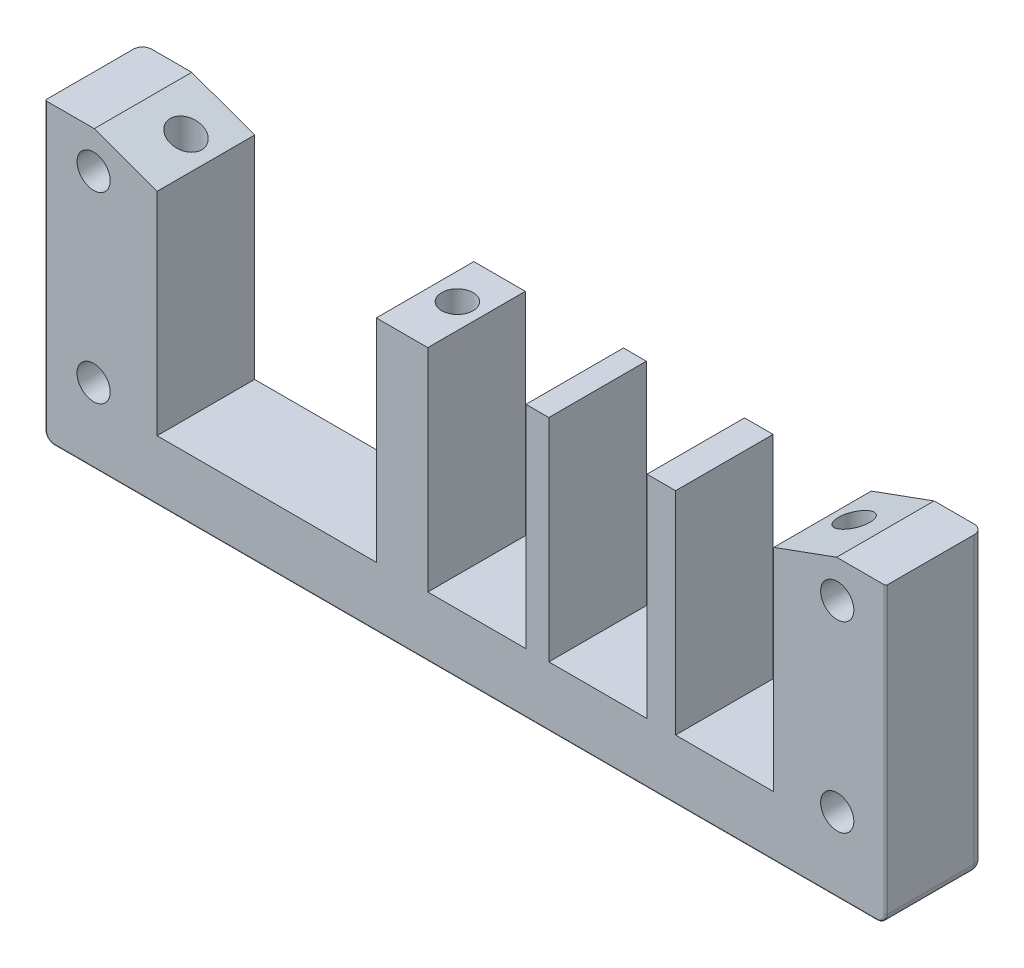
ISO-10303-21;
HEADER;
FILE_DESCRIPTION(('STEP AP214'),'2;1');
FILE_NAME('part.step','',(''),(''),'','','');
FILE_SCHEMA(('AUTOMOTIVE_DESIGN { 1 0 10303 214 1 1 1 1 }'));
ENDSEC;
DATA;
#1=APPLICATION_CONTEXT('core data for automotive mechanical design processes');
#2=APPLICATION_PROTOCOL_DEFINITION('international standard','automotive_design',2000,#1);
#3=PRODUCT_CONTEXT('',#1,'mechanical');
#4=PRODUCT('Part','Part','',(#3));
#5=PRODUCT_RELATED_PRODUCT_CATEGORY('part','',(#4));
#6=PRODUCT_DEFINITION_FORMATION('','',#4);
#7=PRODUCT_DEFINITION_CONTEXT('part definition',#1,'design');
#8=PRODUCT_DEFINITION('design','',#6,#7);
#9=PRODUCT_DEFINITION_SHAPE('','',#8);
#10=(LENGTH_UNIT() NAMED_UNIT(*) SI_UNIT(.MILLI.,.METRE.));
#11=(NAMED_UNIT(*) PLANE_ANGLE_UNIT() SI_UNIT($,.RADIAN.));
#12=(NAMED_UNIT(*) SI_UNIT($,.STERADIAN.) SOLID_ANGLE_UNIT());
#13=UNCERTAINTY_MEASURE_WITH_UNIT(LENGTH_MEASURE(1.E-05),#10,'distance_accuracy_value','');
#14=(GEOMETRIC_REPRESENTATION_CONTEXT(3) GLOBAL_UNCERTAINTY_ASSIGNED_CONTEXT((#13)) GLOBAL_UNIT_ASSIGNED_CONTEXT((#10,
#11,#12)) REPRESENTATION_CONTEXT('',''));
#15=CARTESIAN_POINT('',(0.,0.,0.));
#16=DIRECTION('',(0.,0.,1.));
#17=DIRECTION('',(1.,0.,0.));
#18=AXIS2_PLACEMENT_3D('',#15,#16,#17);
#19=CARTESIAN_POINT('',(60.7671361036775,-22.,3.4));
#20=DIRECTION('',(0.86602540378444,0.,-0.5));
#21=DIRECTION('',(0.,-1.,0.));
#22=AXIS2_PLACEMENT_3D('',#19,#20,#21);
#23=PLANE('',#22);
#24=DIRECTION('',(0.5,0.,0.86602540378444));
#25=VECTOR('',#24,1.);
#26=CARTESIAN_POINT('',(60.7671361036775,-29.,3.4));
#27=LINE('',#26,#25);
#28=CARTESIAN_POINT('',(60.7671361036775,-29.,3.4));
#29=VERTEX_POINT('',#28);
#30=CARTESIAN_POINT('',(63.1342722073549,-29.,7.5));
#31=VERTEX_POINT('',#30);
#32=EDGE_CURVE('E1135',#29,#31,#27,.T.);
#33=ORIENTED_EDGE('',*,*,#32,.T.);
#34=DIRECTION('',(0.,-1.,0.));
#35=VECTOR('',#34,1.);
#36=CARTESIAN_POINT('',(63.1342722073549,-22.,7.5));
#37=LINE('',#36,#35);
#38=CARTESIAN_POINT('',(63.1342722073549,-22.,7.5));
#39=VERTEX_POINT('',#38);
#40=EDGE_CURVE('E11',#39,#31,#37,.T.);
#41=ORIENTED_EDGE('',*,*,#40,.F.);
#42=DIRECTION('',(0.5,0.,0.86602540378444));
#43=VECTOR('',#42,1.);
#44=CARTESIAN_POINT('',(60.7671361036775,-22.,3.4));
#45=LINE('',#44,#43);
#46=CARTESIAN_POINT('',(60.7671361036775,-22.,3.4));
#47=VERTEX_POINT('',#46);
#48=EDGE_CURVE('E621',#47,#39,#45,.T.);
#49=ORIENTED_EDGE('',*,*,#48,.F.);
#50=DIRECTION('',(0.,-1.,0.));
#51=VECTOR('',#50,1.);
#52=CARTESIAN_POINT('',(60.7671361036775,-22.,3.4));
#53=LINE('',#52,#51);
#54=EDGE_CURVE('E641',#47,#29,#53,.T.);
#55=ORIENTED_EDGE('',*,*,#54,.T.);
#56=EDGE_LOOP('',(#33,#41,#49,#55));
#57=FACE_BOUND('',#56,.T.);
#58=ADVANCED_FACE('F16',(#57),#23,.F.);
#59=CARTESIAN_POINT('',(63.1342722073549,-22.,7.5));
#60=DIRECTION('',(0.86602540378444,0.,0.5));
#61=DIRECTION('',(0.,-1.,0.));
#62=AXIS2_PLACEMENT_3D('',#59,#60,#61);
#63=PLANE('',#62);
#64=DIRECTION('',(-0.5,0.,0.86602540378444));
#65=VECTOR('',#64,1.);
#66=CARTESIAN_POINT('',(63.1342722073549,-29.,7.5));
#67=LINE('',#66,#65);
#68=CARTESIAN_POINT('',(60.7671361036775,-29.,11.6));
#69=VERTEX_POINT('',#68);
#70=EDGE_CURVE('E660',#31,#69,#67,.T.);
#71=ORIENTED_EDGE('',*,*,#70,.T.);
#72=DIRECTION('',(0.,-1.,0.));
#73=VECTOR('',#72,1.);
#74=CARTESIAN_POINT('',(60.7671361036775,-22.,11.6));
#75=LINE('',#74,#73);
#76=CARTESIAN_POINT('',(60.7671361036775,-22.,11.6));
#77=VERTEX_POINT('',#76);
#78=EDGE_CURVE('E25',#77,#69,#75,.T.);
#79=ORIENTED_EDGE('',*,*,#78,.F.);
#80=DIRECTION('',(-0.5,0.,0.86602540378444));
#81=VECTOR('',#80,1.);
#82=CARTESIAN_POINT('',(63.1342722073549,-22.,7.5));
#83=LINE('',#82,#81);
#84=EDGE_CURVE('E625',#39,#77,#83,.T.);
#85=ORIENTED_EDGE('',*,*,#84,.F.);
#86=ORIENTED_EDGE('',*,*,#40,.T.);
#87=EDGE_LOOP('',(#71,#79,#85,#86));
#88=FACE_BOUND('',#87,.T.);
#89=ADVANCED_FACE('F661',(#88),#63,.F.);
#90=CARTESIAN_POINT('',(60.7671361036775,-22.,11.6));
#91=DIRECTION('',(0.,0.,1.));
#92=DIRECTION('',(1.,0.,0.));
#93=AXIS2_PLACEMENT_3D('',#90,#91,#92);
#94=PLANE('',#93);
#95=DIRECTION('',(-1.,0.,0.));
#96=VECTOR('',#95,1.);
#97=CARTESIAN_POINT('',(60.7671361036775,-29.,11.6));
#98=LINE('',#97,#96);
#99=CARTESIAN_POINT('',(56.0328638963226,-29.,11.6));
#100=VERTEX_POINT('',#99);
#101=EDGE_CURVE('E657',#69,#100,#98,.T.);
#102=ORIENTED_EDGE('',*,*,#101,.T.);
#103=DIRECTION('',(0.,-1.,0.));
#104=VECTOR('',#103,1.);
#105=CARTESIAN_POINT('',(56.0328638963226,-22.,11.6));
#106=LINE('',#105,#104);
#107=CARTESIAN_POINT('',(56.0328638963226,-22.,11.6));
#108=VERTEX_POINT('',#107);
#109=EDGE_CURVE('E649',#108,#100,#106,.T.);
#110=ORIENTED_EDGE('',*,*,#109,.F.);
#111=DIRECTION('',(-1.,0.,0.));
#112=VECTOR('',#111,1.);
#113=CARTESIAN_POINT('',(60.7671361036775,-22.,11.6));
#114=LINE('',#113,#112);
#115=EDGE_CURVE('E629',#77,#108,#114,.T.);
#116=ORIENTED_EDGE('',*,*,#115,.F.);
#117=ORIENTED_EDGE('',*,*,#78,.T.);
#118=EDGE_LOOP('',(#102,#110,#116,#117));
#119=FACE_BOUND('',#118,.T.);
#120=ADVANCED_FACE('F655',(#119),#94,.F.);
#121=CARTESIAN_POINT('',(56.0328638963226,-22.,11.6));
#122=DIRECTION('',(-0.866025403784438,0.,0.5));
#123=DIRECTION('',(0.,1.,0.));
#124=AXIS2_PLACEMENT_3D('',#121,#122,#123);
#125=PLANE('',#124);
#126=DIRECTION('',(-0.5,0.,-0.866025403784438));
#127=VECTOR('',#126,1.);
#128=CARTESIAN_POINT('',(56.0328638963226,-29.,11.6));
#129=LINE('',#128,#127);
#130=CARTESIAN_POINT('',(53.6657277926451,-29.,7.5));
#131=VERTEX_POINT('',#130);
#132=EDGE_CURVE('E670',#100,#131,#129,.T.);
#133=ORIENTED_EDGE('',*,*,#132,.T.);
#134=DIRECTION('',(0.,-1.,0.));
#135=VECTOR('',#134,1.);
#136=CARTESIAN_POINT('',(53.6657277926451,-22.,7.5));
#137=LINE('',#136,#135);
#138=CARTESIAN_POINT('',(53.6657277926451,-22.,7.5));
#139=VERTEX_POINT('',#138);
#140=EDGE_CURVE('E37',#139,#131,#137,.T.);
#141=ORIENTED_EDGE('',*,*,#140,.F.);
#142=DIRECTION('',(-0.5,0.,-0.866025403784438));
#143=VECTOR('',#142,1.);
#144=CARTESIAN_POINT('',(56.0328638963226,-22.,11.6));
#145=LINE('',#144,#143);
#146=EDGE_CURVE('E633',#108,#139,#145,.T.);
#147=ORIENTED_EDGE('',*,*,#146,.F.);
#148=ORIENTED_EDGE('',*,*,#109,.T.);
#149=EDGE_LOOP('',(#133,#141,#147,#148));
#150=FACE_BOUND('',#149,.T.);
#151=ADVANCED_FACE('F1658',(#150),#125,.F.);
#152=CARTESIAN_POINT('',(53.6657277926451,-22.,7.5));
#153=DIRECTION('',(-0.866025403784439,0.,-0.5));
#154=DIRECTION('',(-0.5,0.,0.866025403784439));
#155=AXIS2_PLACEMENT_3D('',#152,#153,#154);
#156=PLANE('',#155);
#157=DIRECTION('',(0.5,0.,-0.866025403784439));
#158=VECTOR('',#157,1.);
#159=CARTESIAN_POINT('',(53.6657277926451,-29.,7.5));
#160=LINE('',#159,#158);
#161=CARTESIAN_POINT('',(56.0328638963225,-29.,3.4));
#162=VERTEX_POINT('',#161);
#163=EDGE_CURVE('E677',#131,#162,#160,.T.);
#164=ORIENTED_EDGE('',*,*,#163,.T.);
#165=DIRECTION('',(0.,-1.,0.));
#166=VECTOR('',#165,1.);
#167=CARTESIAN_POINT('',(56.0328638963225,-22.,3.4));
#168=LINE('',#167,#166);
#169=CARTESIAN_POINT('',(56.0328638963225,-22.,3.4));
#170=VERTEX_POINT('',#169);
#171=EDGE_CURVE('E644',#170,#162,#168,.T.);
#172=ORIENTED_EDGE('',*,*,#171,.F.);
#173=DIRECTION('',(0.5,0.,-0.866025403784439));
#174=VECTOR('',#173,1.);
#175=CARTESIAN_POINT('',(53.6657277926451,-22.,7.5));
#176=LINE('',#175,#174);
#177=EDGE_CURVE('E637',#139,#170,#176,.T.);
#178=ORIENTED_EDGE('',*,*,#177,.F.);
#179=ORIENTED_EDGE('',*,*,#140,.T.);
#180=EDGE_LOOP('',(#164,#172,#178,#179));
#181=FACE_BOUND('',#180,.T.);
#182=ADVANCED_FACE('F1315',(#181),#156,.F.);
#183=CARTESIAN_POINT('',(56.0328638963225,-22.,3.4));
#184=DIRECTION('',(0.,0.,-1.));
#185=DIRECTION('',(-1.,0.,0.));
#186=AXIS2_PLACEMENT_3D('',#183,#184,#185);
#187=PLANE('',#186);
#188=DIRECTION('',(1.,0.,0.));
#189=VECTOR('',#188,1.);
#190=CARTESIAN_POINT('',(56.0328638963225,-29.,3.4));
#191=LINE('',#190,#189);
#192=EDGE_CURVE('E1142',#162,#29,#191,.T.);
#193=ORIENTED_EDGE('',*,*,#192,.T.);
#194=ORIENTED_EDGE('',*,*,#54,.F.);
#195=DIRECTION('',(1.,0.,0.));
#196=VECTOR('',#195,1.);
#197=CARTESIAN_POINT('',(56.0328638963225,-22.,3.4));
#198=LINE('',#197,#196);
#199=EDGE_CURVE('E617',#170,#47,#198,.T.);
#200=ORIENTED_EDGE('',*,*,#199,.F.);
#201=ORIENTED_EDGE('',*,*,#171,.T.);
#202=EDGE_LOOP('',(#193,#194,#200,#201));
#203=FACE_BOUND('',#202,.T.);
#204=ADVANCED_FACE('F1312',(#203),#187,.F.);
#205=CARTESIAN_POINT('',(0.,-22.,0.));
#206=DIRECTION('',(0.,-1.,0.));
#207=DIRECTION('',(0.,0.,-1.));
#208=AXIS2_PLACEMENT_3D('',#205,#206,#207);
#209=PLANE('',#208);
#210=CARTESIAN_POINT('',(58.4,-22.,7.5));
#211=DIRECTION('',(0.,1.,0.));
#212=DIRECTION('',(0.,0.,-1.));
#213=AXIS2_PLACEMENT_3D('',#210,#211,#212);
#214=CIRCLE('',#213,2.75);
#215=CARTESIAN_POINT('',(58.4,-22.,4.75));
#216=VERTEX_POINT('',#215);
#217=EDGE_CURVE('E1340',#216,#216,#214,.T.);
#218=ORIENTED_EDGE('',*,*,#217,.T.);
#219=EDGE_LOOP('',(#218));
#220=FACE_BOUND('',#219,.T.);
#221=ORIENTED_EDGE('',*,*,#199,.T.);
#222=ORIENTED_EDGE('',*,*,#48,.T.);
#223=ORIENTED_EDGE('',*,*,#84,.T.);
#224=ORIENTED_EDGE('',*,*,#115,.T.);
#225=ORIENTED_EDGE('',*,*,#146,.T.);
#226=ORIENTED_EDGE('',*,*,#177,.T.);
#227=EDGE_LOOP('',(#221,#222,#223,#224,#225,#226));
#228=FACE_BOUND('',#227,.T.);
#229=ADVANCED_FACE('F1355',(#220,#228),#209,.T.);
#230=CARTESIAN_POINT('',(-8.58286389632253,-22.,3.4));
#231=DIRECTION('',(0.866025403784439,0.,-0.5));
#232=DIRECTION('',(0.,-1.,0.));
#233=AXIS2_PLACEMENT_3D('',#230,#231,#232);
#234=PLANE('',#233);
#235=DIRECTION('',(0.5,0.,0.866025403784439));
#236=VECTOR('',#235,1.);
#237=CARTESIAN_POINT('',(-8.58286389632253,-29.,3.4));
#238=LINE('',#237,#236);
#239=CARTESIAN_POINT('',(-8.58286389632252,-29.,3.4));
#240=VERTEX_POINT('',#239);
#241=CARTESIAN_POINT('',(-6.21572779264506,-29.,7.5));
#242=VERTEX_POINT('',#241);
#243=EDGE_CURVE('E665',#240,#242,#238,.T.);
#244=ORIENTED_EDGE('',*,*,#243,.T.);
#245=DIRECTION('',(0.,-1.,0.));
#246=VECTOR('',#245,1.);
#247=CARTESIAN_POINT('',(-6.21572779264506,-22.,7.5));
#248=LINE('',#247,#246);
#249=CARTESIAN_POINT('',(-6.21572779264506,-22.,7.5));
#250=VERTEX_POINT('',#249);
#251=EDGE_CURVE('E614',#250,#242,#248,.T.);
#252=ORIENTED_EDGE('',*,*,#251,.F.);
#253=DIRECTION('',(0.5,0.,0.866025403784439));
#254=VECTOR('',#253,1.);
#255=CARTESIAN_POINT('',(-8.58286389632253,-22.,3.4));
#256=LINE('',#255,#254);
#257=CARTESIAN_POINT('',(-8.58286389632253,-22.,3.4));
#258=VERTEX_POINT('',#257);
#259=EDGE_CURVE('E579',#258,#250,#256,.T.);
#260=ORIENTED_EDGE('',*,*,#259,.F.);
#261=DIRECTION('',(0.,-1.,0.));
#262=VECTOR('',#261,1.);
#263=CARTESIAN_POINT('',(-8.58286389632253,-22.,3.4));
#264=LINE('',#263,#262);
#265=EDGE_CURVE('E599',#258,#240,#264,.T.);
#266=ORIENTED_EDGE('',*,*,#265,.T.);
#267=EDGE_LOOP('',(#244,#252,#260,#266));
#268=FACE_BOUND('',#267,.T.);
#269=ADVANCED_FACE('F1976',(#268),#234,.F.);
#270=CARTESIAN_POINT('',(-6.21572779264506,-22.,7.5));
#271=DIRECTION('',(0.866025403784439,0.,0.5));
#272=DIRECTION('',(0.,-1.,0.));
#273=AXIS2_PLACEMENT_3D('',#270,#271,#272);
#274=PLANE('',#273);
#275=DIRECTION('',(-0.5,0.,0.866025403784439));
#276=VECTOR('',#275,1.);
#277=CARTESIAN_POINT('',(-6.21572779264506,-29.,7.5));
#278=LINE('',#277,#276);
#279=CARTESIAN_POINT('',(-8.58286389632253,-29.,11.6));
#280=VERTEX_POINT('',#279);
#281=EDGE_CURVE('E722',#242,#280,#278,.T.);
#282=ORIENTED_EDGE('',*,*,#281,.T.);
#283=DIRECTION('',(0.,-1.,0.));
#284=VECTOR('',#283,1.);
#285=CARTESIAN_POINT('',(-8.58286389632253,-22.,11.6));
#286=LINE('',#285,#284);
#287=CARTESIAN_POINT('',(-8.58286389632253,-22.,11.6));
#288=VERTEX_POINT('',#287);
#289=EDGE_CURVE('E611',#288,#280,#286,.T.);
#290=ORIENTED_EDGE('',*,*,#289,.F.);
#291=DIRECTION('',(-0.5,0.,0.866025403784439));
#292=VECTOR('',#291,1.);
#293=CARTESIAN_POINT('',(-6.21572779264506,-22.,7.5));
#294=LINE('',#293,#292);
#295=EDGE_CURVE('E583',#250,#288,#294,.T.);
#296=ORIENTED_EDGE('',*,*,#295,.F.);
#297=ORIENTED_EDGE('',*,*,#251,.T.);
#298=EDGE_LOOP('',(#282,#290,#296,#297));
#299=FACE_BOUND('',#298,.T.);
#300=ADVANCED_FACE('F1376',(#299),#274,.F.);
#301=CARTESIAN_POINT('',(-8.58286389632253,-22.,11.6));
#302=DIRECTION('',(0.,0.,1.));
#303=DIRECTION('',(1.,0.,0.));
#304=AXIS2_PLACEMENT_3D('',#301,#302,#303);
#305=PLANE('',#304);
#306=DIRECTION('',(-1.,0.,0.));
#307=VECTOR('',#306,1.);
#308=CARTESIAN_POINT('',(-8.58286389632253,-29.,11.6));
#309=LINE('',#308,#307);
#310=CARTESIAN_POINT('',(-13.3171361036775,-29.,11.6));
#311=VERTEX_POINT('',#310);
#312=EDGE_CURVE('E715',#280,#311,#309,.T.);
#313=ORIENTED_EDGE('',*,*,#312,.T.);
#314=DIRECTION('',(0.,-1.,0.));
#315=VECTOR('',#314,1.);
#316=CARTESIAN_POINT('',(-13.3171361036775,-22.,11.6));
#317=LINE('',#316,#315);
#318=CARTESIAN_POINT('',(-13.3171361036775,-22.,11.6));
#319=VERTEX_POINT('',#318);
#320=EDGE_CURVE('E608',#319,#311,#317,.T.);
#321=ORIENTED_EDGE('',*,*,#320,.F.);
#322=DIRECTION('',(-1.,0.,0.));
#323=VECTOR('',#322,1.);
#324=CARTESIAN_POINT('',(-8.58286389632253,-22.,11.6));
#325=LINE('',#324,#323);
#326=EDGE_CURVE('E587',#288,#319,#325,.T.);
#327=ORIENTED_EDGE('',*,*,#326,.F.);
#328=ORIENTED_EDGE('',*,*,#289,.T.);
#329=EDGE_LOOP('',(#313,#321,#327,#328));
#330=FACE_BOUND('',#329,.T.);
#331=ADVANCED_FACE('F1372',(#330),#305,.F.);
#332=CARTESIAN_POINT('',(-13.3171361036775,-22.,11.6));
#333=DIRECTION('',(-0.866025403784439,0.,0.5));
#334=DIRECTION('',(0.,1.,0.));
#335=AXIS2_PLACEMENT_3D('',#332,#333,#334);
#336=PLANE('',#335);
#337=DIRECTION('',(-0.5,0.,-0.866025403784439));
#338=VECTOR('',#337,1.);
#339=CARTESIAN_POINT('',(-13.3171361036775,-29.,11.6));
#340=LINE('',#339,#338);
#341=CARTESIAN_POINT('',(-15.6842722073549,-29.,7.5));
#342=VERTEX_POINT('',#341);
#343=EDGE_CURVE('E711',#311,#342,#340,.T.);
#344=ORIENTED_EDGE('',*,*,#343,.T.);
#345=DIRECTION('',(0.,-1.,0.));
#346=VECTOR('',#345,1.);
#347=CARTESIAN_POINT('',(-15.6842722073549,-22.,7.5));
#348=LINE('',#347,#346);
#349=CARTESIAN_POINT('',(-15.6842722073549,-22.,7.5));
#350=VERTEX_POINT('',#349);
#351=EDGE_CURVE('E605',#350,#342,#348,.T.);
#352=ORIENTED_EDGE('',*,*,#351,.F.);
#353=DIRECTION('',(-0.5,0.,-0.866025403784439));
#354=VECTOR('',#353,1.);
#355=CARTESIAN_POINT('',(-13.3171361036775,-22.,11.6));
#356=LINE('',#355,#354);
#357=EDGE_CURVE('E591',#319,#350,#356,.T.);
#358=ORIENTED_EDGE('',*,*,#357,.F.);
#359=ORIENTED_EDGE('',*,*,#320,.T.);
#360=EDGE_LOOP('',(#344,#352,#358,#359));
#361=FACE_BOUND('',#360,.T.);
#362=ADVANCED_FACE('F1375',(#361),#336,.F.);
#363=CARTESIAN_POINT('',(-15.6842722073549,-22.,7.5));
#364=DIRECTION('',(-0.866025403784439,0.,-0.5));
#365=DIRECTION('',(-0.5,0.,0.866025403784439));
#366=AXIS2_PLACEMENT_3D('',#363,#364,#365);
#367=PLANE('',#366);
#368=DIRECTION('',(0.5,0.,-0.866025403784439));
#369=VECTOR('',#368,1.);
#370=CARTESIAN_POINT('',(-15.6842722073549,-29.,7.5));
#371=LINE('',#370,#369);
#372=CARTESIAN_POINT('',(-13.3171361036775,-29.,3.4));
#373=VERTEX_POINT('',#372);
#374=EDGE_CURVE('E705',#342,#373,#371,.T.);
#375=ORIENTED_EDGE('',*,*,#374,.T.);
#376=DIRECTION('',(0.,-1.,0.));
#377=VECTOR('',#376,1.);
#378=CARTESIAN_POINT('',(-13.3171361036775,-22.,3.4));
#379=LINE('',#378,#377);
#380=CARTESIAN_POINT('',(-13.3171361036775,-22.,3.4));
#381=VERTEX_POINT('',#380);
#382=EDGE_CURVE('E602',#381,#373,#379,.T.);
#383=ORIENTED_EDGE('',*,*,#382,.F.);
#384=DIRECTION('',(0.5,0.,-0.866025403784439));
#385=VECTOR('',#384,1.);
#386=CARTESIAN_POINT('',(-15.6842722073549,-22.,7.5));
#387=LINE('',#386,#385);
#388=EDGE_CURVE('E595',#350,#381,#387,.T.);
#389=ORIENTED_EDGE('',*,*,#388,.F.);
#390=ORIENTED_EDGE('',*,*,#351,.T.);
#391=EDGE_LOOP('',(#375,#383,#389,#390));
#392=FACE_BOUND('',#391,.T.);
#393=ADVANCED_FACE('F1950',(#392),#367,.F.);
#394=CARTESIAN_POINT('',(-13.3171361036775,-22.,3.4));
#395=DIRECTION('',(0.,0.,-1.));
#396=DIRECTION('',(0.,-1.,0.));
#397=AXIS2_PLACEMENT_3D('',#394,#395,#396);
#398=PLANE('',#397);
#399=DIRECTION('',(1.,0.,0.));
#400=VECTOR('',#399,1.);
#401=CARTESIAN_POINT('',(-13.3171361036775,-29.,3.4));
#402=LINE('',#401,#400);
#403=EDGE_CURVE('E690',#373,#240,#402,.T.);
#404=ORIENTED_EDGE('',*,*,#403,.T.);
#405=ORIENTED_EDGE('',*,*,#265,.F.);
#406=DIRECTION('',(1.,0.,0.));
#407=VECTOR('',#406,1.);
#408=CARTESIAN_POINT('',(-13.3171361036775,-22.,3.4));
#409=LINE('',#408,#407);
#410=EDGE_CURVE('E575',#381,#258,#409,.T.);
#411=ORIENTED_EDGE('',*,*,#410,.F.);
#412=ORIENTED_EDGE('',*,*,#382,.T.);
#413=EDGE_LOOP('',(#404,#405,#411,#412));
#414=FACE_BOUND('',#413,.T.);
#415=ADVANCED_FACE('F1941',(#414),#398,.F.);
#416=CARTESIAN_POINT('',(0.,-22.,0.));
#417=DIRECTION('',(0.,-1.,0.));
#418=DIRECTION('',(0.,0.,-1.));
#419=AXIS2_PLACEMENT_3D('',#416,#417,#418);
#420=PLANE('',#419);
#421=CARTESIAN_POINT('',(-10.95,-22.,7.5));
#422=DIRECTION('',(0.,1.,0.));
#423=DIRECTION('',(1.,0.,0.));
#424=AXIS2_PLACEMENT_3D('',#421,#422,#423);
#425=CIRCLE('',#424,2.75);
#426=CARTESIAN_POINT('',(-8.2,-22.,7.5));
#427=VERTEX_POINT('',#426);
#428=EDGE_CURVE('E1329',#427,#427,#425,.T.);
#429=ORIENTED_EDGE('',*,*,#428,.T.);
#430=EDGE_LOOP('',(#429));
#431=FACE_BOUND('',#430,.T.);
#432=ORIENTED_EDGE('',*,*,#410,.T.);
#433=ORIENTED_EDGE('',*,*,#259,.T.);
#434=ORIENTED_EDGE('',*,*,#295,.T.);
#435=ORIENTED_EDGE('',*,*,#326,.T.);
#436=ORIENTED_EDGE('',*,*,#357,.T.);
#437=ORIENTED_EDGE('',*,*,#388,.T.);
#438=EDGE_LOOP('',(#432,#433,#434,#435,#436,#437));
#439=FACE_BOUND('',#438,.T.);
#440=ADVANCED_FACE('F1597',(#431,#439),#420,.T.);
#441=CARTESIAN_POINT('',(-56.0328638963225,-22.,3.4));
#442=DIRECTION('',(0.866025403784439,0.,-0.5));
#443=DIRECTION('',(0.,-1.,0.));
#444=AXIS2_PLACEMENT_3D('',#441,#442,#443);
#445=PLANE('',#444);
#446=DIRECTION('',(0.5,0.,0.866025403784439));
#447=VECTOR('',#446,1.);
#448=CARTESIAN_POINT('',(-56.0328638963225,-29.,3.4));
#449=LINE('',#448,#447);
#450=CARTESIAN_POINT('',(-56.0328638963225,-29.,3.4));
#451=VERTEX_POINT('',#450);
#452=CARTESIAN_POINT('',(-53.6657277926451,-29.,7.5));
#453=VERTEX_POINT('',#452);
#454=EDGE_CURVE('E726',#451,#453,#449,.T.);
#455=ORIENTED_EDGE('',*,*,#454,.T.);
#456=DIRECTION('',(0.,-1.,0.));
#457=VECTOR('',#456,1.);
#458=CARTESIAN_POINT('',(-53.6657277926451,-22.,7.5));
#459=LINE('',#458,#457);
#460=CARTESIAN_POINT('',(-53.6657277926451,-22.,7.5));
#461=VERTEX_POINT('',#460);
#462=EDGE_CURVE('E533',#461,#453,#459,.T.);
#463=ORIENTED_EDGE('',*,*,#462,.F.);
#464=DIRECTION('',(0.5,0.,0.866025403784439));
#465=VECTOR('',#464,1.);
#466=CARTESIAN_POINT('',(-56.0328638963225,-22.,3.4));
#467=LINE('',#466,#465);
#468=CARTESIAN_POINT('',(-56.0328638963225,-22.,3.4));
#469=VERTEX_POINT('',#468);
#470=EDGE_CURVE('E531',#469,#461,#467,.T.);
#471=ORIENTED_EDGE('',*,*,#470,.F.);
#472=DIRECTION('',(0.,-1.,0.));
#473=VECTOR('',#472,1.);
#474=CARTESIAN_POINT('',(-56.0328638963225,-22.,3.4));
#475=LINE('',#474,#473);
#476=EDGE_CURVE('E516',#469,#451,#475,.T.);
#477=ORIENTED_EDGE('',*,*,#476,.T.);
#478=EDGE_LOOP('',(#455,#463,#471,#477));
#479=FACE_BOUND('',#478,.T.);
#480=ADVANCED_FACE('F532',(#479),#445,.F.);
#481=CARTESIAN_POINT('',(-53.6657277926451,-22.,7.5));
#482=DIRECTION('',(0.866025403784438,0.,0.5));
#483=DIRECTION('',(0.,-1.,0.));
#484=AXIS2_PLACEMENT_3D('',#481,#482,#483);
#485=PLANE('',#484);
#486=DIRECTION('',(-0.5,0.,0.866025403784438));
#487=VECTOR('',#486,1.);
#488=CARTESIAN_POINT('',(-53.6657277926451,-29.,7.5));
#489=LINE('',#488,#487);
#490=CARTESIAN_POINT('',(-56.0328638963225,-29.,11.6));
#491=VERTEX_POINT('',#490);
#492=EDGE_CURVE('E761',#453,#491,#489,.T.);
#493=ORIENTED_EDGE('',*,*,#492,.T.);
#494=DIRECTION('',(0.,-1.,0.));
#495=VECTOR('',#494,1.);
#496=CARTESIAN_POINT('',(-56.0328638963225,-22.,11.6));
#497=LINE('',#496,#495);
#498=CARTESIAN_POINT('',(-56.0328638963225,-22.,11.6));
#499=VERTEX_POINT('',#498);
#500=EDGE_CURVE('E570',#499,#491,#497,.T.);
#501=ORIENTED_EDGE('',*,*,#500,.F.);
#502=DIRECTION('',(-0.5,0.,0.866025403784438));
#503=VECTOR('',#502,1.);
#504=CARTESIAN_POINT('',(-53.6657277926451,-22.,7.5));
#505=LINE('',#504,#503);
#506=EDGE_CURVE('E538',#461,#499,#505,.T.);
#507=ORIENTED_EDGE('',*,*,#506,.F.);
#508=ORIENTED_EDGE('',*,*,#462,.T.);
#509=EDGE_LOOP('',(#493,#501,#507,#508));
#510=FACE_BOUND('',#509,.T.);
#511=ADVANCED_FACE('F1596',(#510),#485,.F.);
#512=CARTESIAN_POINT('',(-56.0328638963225,-22.,11.6));
#513=DIRECTION('',(0.,0.,1.));
#514=DIRECTION('',(1.,0.,0.));
#515=AXIS2_PLACEMENT_3D('',#512,#513,#514);
#516=PLANE('',#515);
#517=DIRECTION('',(-1.,0.,0.));
#518=VECTOR('',#517,1.);
#519=CARTESIAN_POINT('',(-56.0328638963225,-29.,11.6));
#520=LINE('',#519,#518);
#521=CARTESIAN_POINT('',(-60.7671361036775,-29.,11.6));
#522=VERTEX_POINT('',#521);
#523=EDGE_CURVE('E749',#491,#522,#520,.T.);
#524=ORIENTED_EDGE('',*,*,#523,.T.);
#525=DIRECTION('',(0.,-1.,0.));
#526=VECTOR('',#525,1.);
#527=CARTESIAN_POINT('',(-60.7671361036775,-22.,11.6));
#528=LINE('',#527,#526);
#529=CARTESIAN_POINT('',(-60.7671361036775,-22.,11.6));
#530=VERTEX_POINT('',#529);
#531=EDGE_CURVE('E567',#530,#522,#528,.T.);
#532=ORIENTED_EDGE('',*,*,#531,.F.);
#533=DIRECTION('',(-1.,0.,0.));
#534=VECTOR('',#533,1.);
#535=CARTESIAN_POINT('',(-56.0328638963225,-22.,11.6));
#536=LINE('',#535,#534);
#537=EDGE_CURVE('E555',#499,#530,#536,.T.);
#538=ORIENTED_EDGE('',*,*,#537,.F.);
#539=ORIENTED_EDGE('',*,*,#500,.T.);
#540=EDGE_LOOP('',(#524,#532,#538,#539));
#541=FACE_BOUND('',#540,.T.);
#542=ADVANCED_FACE('F1915',(#541),#516,.F.);
#543=CARTESIAN_POINT('',(-60.7671361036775,-22.,11.6));
#544=DIRECTION('',(-0.866025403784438,0.,0.5));
#545=DIRECTION('',(0.,1.,0.));
#546=AXIS2_PLACEMENT_3D('',#543,#544,#545);
#547=PLANE('',#546);
#548=DIRECTION('',(-0.5,0.,-0.866025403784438));
#549=VECTOR('',#548,1.);
#550=CARTESIAN_POINT('',(-60.7671361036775,-29.,11.6));
#551=LINE('',#550,#549);
#552=CARTESIAN_POINT('',(-63.1342722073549,-29.,7.5));
#553=VERTEX_POINT('',#552);
#554=EDGE_CURVE('E741',#522,#553,#551,.T.);
#555=ORIENTED_EDGE('',*,*,#554,.T.);
#556=DIRECTION('',(0.,-1.,0.));
#557=VECTOR('',#556,1.);
#558=CARTESIAN_POINT('',(-63.1342722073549,-22.,7.5));
#559=LINE('',#558,#557);
#560=CARTESIAN_POINT('',(-63.1342722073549,-22.,7.5));
#561=VERTEX_POINT('',#560);
#562=EDGE_CURVE('E564',#561,#553,#559,.T.);
#563=ORIENTED_EDGE('',*,*,#562,.F.);
#564=DIRECTION('',(-0.5,0.,-0.866025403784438));
#565=VECTOR('',#564,1.);
#566=CARTESIAN_POINT('',(-60.7671361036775,-22.,11.6));
#567=LINE('',#566,#565);
#568=EDGE_CURVE('E559',#530,#561,#567,.T.);
#569=ORIENTED_EDGE('',*,*,#568,.F.);
#570=ORIENTED_EDGE('',*,*,#531,.T.);
#571=EDGE_LOOP('',(#555,#563,#569,#570));
#572=FACE_BOUND('',#571,.T.);
#573=ADVANCED_FACE('F1905',(#572),#547,.F.);
#574=CARTESIAN_POINT('',(-63.1342722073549,-22.,7.5));
#575=DIRECTION('',(-0.866025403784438,0.,-0.5));
#576=DIRECTION('',(-0.5,0.,0.866025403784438));
#577=AXIS2_PLACEMENT_3D('',#574,#575,#576);
#578=PLANE('',#577);
#579=DIRECTION('',(0.5,0.,-0.866025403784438));
#580=VECTOR('',#579,1.);
#581=CARTESIAN_POINT('',(-63.1342722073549,-29.,7.5));
#582=LINE('',#581,#580);
#583=CARTESIAN_POINT('',(-60.7671361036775,-29.,3.4));
#584=VERTEX_POINT('',#583);
#585=EDGE_CURVE('E731',#553,#584,#582,.T.);
#586=ORIENTED_EDGE('',*,*,#585,.T.);
#587=DIRECTION('',(0.,-1.,0.));
#588=VECTOR('',#587,1.);
#589=CARTESIAN_POINT('',(-60.7671361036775,-22.,3.4));
#590=LINE('',#589,#588);
#591=CARTESIAN_POINT('',(-60.7671361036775,-22.,3.4));
#592=VERTEX_POINT('',#591);
#593=EDGE_CURVE('E527',#592,#584,#590,.T.);
#594=ORIENTED_EDGE('',*,*,#593,.F.);
#595=DIRECTION('',(0.5,0.,-0.866025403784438));
#596=VECTOR('',#595,1.);
#597=CARTESIAN_POINT('',(-63.1342722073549,-22.,7.5));
#598=LINE('',#597,#596);
#599=EDGE_CURVE('E528',#561,#592,#598,.T.);
#600=ORIENTED_EDGE('',*,*,#599,.F.);
#601=ORIENTED_EDGE('',*,*,#562,.T.);
#602=EDGE_LOOP('',(#586,#594,#600,#601));
#603=FACE_BOUND('',#602,.T.);
#604=ADVANCED_FACE('F1896',(#603),#578,.F.);
#605=CARTESIAN_POINT('',(-60.7671361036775,-22.,3.4));
#606=DIRECTION('',(0.,0.,-1.));
#607=DIRECTION('',(0.,-1.,0.));
#608=AXIS2_PLACEMENT_3D('',#605,#606,#607);
#609=PLANE('',#608);
#610=DIRECTION('',(1.,0.,0.));
#611=VECTOR('',#610,1.);
#612=CARTESIAN_POINT('',(-60.7671361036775,-29.,3.4));
#613=LINE('',#612,#611);
#614=EDGE_CURVE('E522',#584,#451,#613,.T.);
#615=ORIENTED_EDGE('',*,*,#614,.T.);
#616=ORIENTED_EDGE('',*,*,#476,.F.);
#617=DIRECTION('',(1.,0.,0.));
#618=VECTOR('',#617,1.);
#619=CARTESIAN_POINT('',(-60.7671361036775,-22.,3.4));
#620=LINE('',#619,#618);
#621=EDGE_CURVE('E520',#592,#469,#620,.T.);
#622=ORIENTED_EDGE('',*,*,#621,.F.);
#623=ORIENTED_EDGE('',*,*,#593,.T.);
#624=EDGE_LOOP('',(#615,#616,#622,#623));
#625=FACE_BOUND('',#624,.T.);
#626=ADVANCED_FACE('F518',(#625),#609,.F.);
#627=CARTESIAN_POINT('',(0.,-22.,0.));
#628=DIRECTION('',(0.,-1.,0.));
#629=DIRECTION('',(0.,0.,-1.));
#630=AXIS2_PLACEMENT_3D('',#627,#628,#629);
#631=PLANE('',#630);
#632=CARTESIAN_POINT('',(-58.4,-22.,7.5));
#633=DIRECTION('',(0.,1.,0.));
#634=DIRECTION('',(0.,0.,-1.));
#635=AXIS2_PLACEMENT_3D('',#632,#633,#634);
#636=CIRCLE('',#635,2.75);
#637=CARTESIAN_POINT('',(-58.4,-22.,4.75));
#638=VERTEX_POINT('',#637);
#639=EDGE_CURVE('E1113',#638,#638,#636,.T.);
#640=ORIENTED_EDGE('',*,*,#639,.T.);
#641=EDGE_LOOP('',(#640));
#642=FACE_BOUND('',#641,.T.);
#643=ORIENTED_EDGE('',*,*,#621,.T.);
#644=ORIENTED_EDGE('',*,*,#470,.T.);
#645=ORIENTED_EDGE('',*,*,#506,.T.);
#646=ORIENTED_EDGE('',*,*,#537,.T.);
#647=ORIENTED_EDGE('',*,*,#568,.T.);
#648=ORIENTED_EDGE('',*,*,#599,.T.);
#649=EDGE_LOOP('',(#643,#644,#645,#646,#647,#648));
#650=FACE_BOUND('',#649,.T.);
#651=ADVANCED_FACE('F541',(#642,#650),#631,.T.);
#652=CARTESIAN_POINT('',(65.,16.,0.));
#653=DIRECTION('',(0.,0.,-1.));
#654=DIRECTION('',(-1.,0.,0.));
#655=AXIS2_PLACEMENT_3D('',#652,#653,#654);
#656=CYLINDRICAL_SURFACE('',#655,5.);
#657=CARTESIAN_POINT('',(65.,16.,4.9));
#658=DIRECTION('',(0.,0.,-1.));
#659=DIRECTION('',(-1.,0.,0.));
#660=AXIS2_PLACEMENT_3D('',#657,#658,#659);
#661=CIRCLE('',#660,5.);
#662=CARTESIAN_POINT('',(60.,16.,4.9));
#663=VERTEX_POINT('',#662);
#664=EDGE_CURVE('E545',#663,#663,#661,.T.);
#665=ORIENTED_EDGE('',*,*,#664,.F.);
#666=EDGE_LOOP('',(#665));
#667=FACE_BOUND('',#666,.T.);
#668=CARTESIAN_POINT('',(65.,16.,0.));
#669=DIRECTION('',(0.,0.,-1.));
#670=DIRECTION('',(-1.,0.,0.));
#671=AXIS2_PLACEMENT_3D('',#668,#669,#670);
#672=CIRCLE('',#671,5.);
#673=CARTESIAN_POINT('',(60.,16.,0.));
#674=VERTEX_POINT('',#673);
#675=EDGE_CURVE('E903',#674,#674,#672,.T.);
#676=ORIENTED_EDGE('',*,*,#675,.T.);
#677=EDGE_LOOP('',(#676));
#678=FACE_BOUND('',#677,.T.);
#679=ADVANCED_FACE('F1087',(#667,#678),#656,.F.);
#680=CARTESIAN_POINT('',(67.9,16.,4.9));
#681=DIRECTION('',(0.,0.,1.));
#682=DIRECTION('',(1.,0.,0.));
#683=AXIS2_PLACEMENT_3D('',#680,#681,#682);
#684=PLANE('',#683);
#685=CARTESIAN_POINT('',(65.,16.,4.9));
#686=DIRECTION('',(0.,0.,-1.));
#687=DIRECTION('',(-1.,0.,0.));
#688=AXIS2_PLACEMENT_3D('',#685,#686,#687);
#689=CIRCLE('',#688,2.9);
#690=CARTESIAN_POINT('',(62.1,16.,4.9));
#691=VERTEX_POINT('',#690);
#692=EDGE_CURVE('E549',#691,#691,#689,.T.);
#693=ORIENTED_EDGE('',*,*,#692,.F.);
#694=EDGE_LOOP('',(#693));
#695=FACE_BOUND('',#694,.T.);
#696=ORIENTED_EDGE('',*,*,#664,.T.);
#697=EDGE_LOOP('',(#696));
#698=FACE_BOUND('',#697,.T.);
#699=ADVANCED_FACE('F1084',(#695,#698),#684,.F.);
#700=CARTESIAN_POINT('',(65.,16.,0.));
#701=DIRECTION('',(0.,0.,-1.));
#702=DIRECTION('',(-1.,0.,0.));
#703=AXIS2_PLACEMENT_3D('',#700,#701,#702);
#704=CYLINDRICAL_SURFACE('',#703,2.9);
#705=CARTESIAN_POINT('',(65.,16.,17.05));
#706=DIRECTION('',(0.,0.,-1.));
#707=DIRECTION('',(-1.,0.,0.));
#708=AXIS2_PLACEMENT_3D('',#705,#706,#707);
#709=CIRCLE('',#708,2.9);
#710=CARTESIAN_POINT('',(62.1,16.,17.05));
#711=VERTEX_POINT('',#710);
#712=EDGE_CURVE('E783',#711,#711,#709,.T.);
#713=ORIENTED_EDGE('',*,*,#712,.F.);
#714=EDGE_LOOP('',(#713));
#715=FACE_BOUND('',#714,.T.);
#716=ORIENTED_EDGE('',*,*,#692,.T.);
#717=EDGE_LOOP('',(#716));
#718=FACE_BOUND('',#717,.T.);
#719=ADVANCED_FACE('F1082',(#715,#718),#704,.F.);
#720=CARTESIAN_POINT('',(65.,-16.,0.));
#721=DIRECTION('',(0.,0.,-1.));
#722=DIRECTION('',(-1.,0.,0.));
#723=AXIS2_PLACEMENT_3D('',#720,#721,#722);
#724=CYLINDRICAL_SURFACE('',#723,5.);
#725=CARTESIAN_POINT('',(65.,-16.,4.9));
#726=DIRECTION('',(0.,0.,-1.));
#727=DIRECTION('',(-1.,0.,0.));
#728=AXIS2_PLACEMENT_3D('',#725,#726,#727);
#729=CIRCLE('',#728,5.);
#730=CARTESIAN_POINT('',(60.,-16.,4.9));
#731=VERTEX_POINT('',#730);
#732=EDGE_CURVE('E1076',#731,#731,#729,.T.);
#733=ORIENTED_EDGE('',*,*,#732,.F.);
#734=EDGE_LOOP('',(#733));
#735=FACE_BOUND('',#734,.T.);
#736=CARTESIAN_POINT('',(65.,-16.,0.));
#737=DIRECTION('',(0.,0.,-1.));
#738=DIRECTION('',(-1.,0.,0.));
#739=AXIS2_PLACEMENT_3D('',#736,#737,#738);
#740=CIRCLE('',#739,5.);
#741=CARTESIAN_POINT('',(60.,-16.,0.));
#742=VERTEX_POINT('',#741);
#743=EDGE_CURVE('E899',#742,#742,#740,.T.);
#744=ORIENTED_EDGE('',*,*,#743,.T.);
#745=EDGE_LOOP('',(#744));
#746=FACE_BOUND('',#745,.T.);
#747=ADVANCED_FACE('F1393',(#735,#746),#724,.F.);
#748=CARTESIAN_POINT('',(67.9,-16.,4.9));
#749=DIRECTION('',(0.,0.,1.));
#750=DIRECTION('',(1.,0.,0.));
#751=AXIS2_PLACEMENT_3D('',#748,#749,#750);
#752=PLANE('',#751);
#753=CARTESIAN_POINT('',(65.,-16.,4.9));
#754=DIRECTION('',(0.,0.,-1.));
#755=DIRECTION('',(-1.,0.,0.));
#756=AXIS2_PLACEMENT_3D('',#753,#754,#755);
#757=CIRCLE('',#756,2.9);
#758=CARTESIAN_POINT('',(62.1,-16.,4.9));
#759=VERTEX_POINT('',#758);
#760=EDGE_CURVE('E1073',#759,#759,#757,.T.);
#761=ORIENTED_EDGE('',*,*,#760,.F.);
#762=EDGE_LOOP('',(#761));
#763=FACE_BOUND('',#762,.T.);
#764=ORIENTED_EDGE('',*,*,#732,.T.);
#765=EDGE_LOOP('',(#764));
#766=FACE_BOUND('',#765,.T.);
#767=ADVANCED_FACE('F1685',(#763,#766),#752,.F.);
#768=CARTESIAN_POINT('',(65.,-16.,0.));
#769=DIRECTION('',(0.,0.,-1.));
#770=DIRECTION('',(-1.,0.,0.));
#771=AXIS2_PLACEMENT_3D('',#768,#769,#770);
#772=CYLINDRICAL_SURFACE('',#771,2.9);
#773=CARTESIAN_POINT('',(65.,-16.,17.05));
#774=DIRECTION('',(0.,0.,-1.));
#775=DIRECTION('',(-1.,0.,0.));
#776=AXIS2_PLACEMENT_3D('',#773,#774,#775);
#777=CIRCLE('',#776,2.9);
#778=CARTESIAN_POINT('',(62.1,-16.,17.05));
#779=VERTEX_POINT('',#778);
#780=EDGE_CURVE('E786',#779,#779,#777,.T.);
#781=ORIENTED_EDGE('',*,*,#780,.F.);
#782=EDGE_LOOP('',(#781));
#783=FACE_BOUND('',#782,.T.);
#784=ORIENTED_EDGE('',*,*,#760,.T.);
#785=EDGE_LOOP('',(#784));
#786=FACE_BOUND('',#785,.T.);
#787=ADVANCED_FACE('F1679',(#783,#786),#772,.F.);
#788=CARTESIAN_POINT('',(-65.,-16.,0.));
#789=DIRECTION('',(0.,0.,-1.));
#790=DIRECTION('',(-1.,0.,0.));
#791=AXIS2_PLACEMENT_3D('',#788,#789,#790);
#792=CYLINDRICAL_SURFACE('',#791,5.);
#793=CARTESIAN_POINT('',(-65.,-16.,4.9));
#794=DIRECTION('',(0.,0.,-1.));
#795=DIRECTION('',(-1.,0.,0.));
#796=AXIS2_PLACEMENT_3D('',#793,#794,#795);
#797=CIRCLE('',#796,5.);
#798=CARTESIAN_POINT('',(-70.,-16.,4.9));
#799=VERTEX_POINT('',#798);
#800=EDGE_CURVE('E1070',#799,#799,#797,.T.);
#801=ORIENTED_EDGE('',*,*,#800,.F.);
#802=EDGE_LOOP('',(#801));
#803=FACE_BOUND('',#802,.T.);
#804=CARTESIAN_POINT('',(-65.,-16.,0.));
#805=DIRECTION('',(0.,0.,-1.));
#806=DIRECTION('',(-1.,0.,0.));
#807=AXIS2_PLACEMENT_3D('',#804,#805,#806);
#808=CIRCLE('',#807,5.);
#809=CARTESIAN_POINT('',(-70.,-16.,0.));
#810=VERTEX_POINT('',#809);
#811=EDGE_CURVE('E902',#810,#810,#808,.T.);
#812=ORIENTED_EDGE('',*,*,#811,.T.);
#813=EDGE_LOOP('',(#812));
#814=FACE_BOUND('',#813,.T.);
#815=ADVANCED_FACE('F1684',(#803,#814),#792,.F.);
#816=CARTESIAN_POINT('',(-62.1,-16.,4.9));
#817=DIRECTION('',(0.,0.,1.));
#818=DIRECTION('',(1.,0.,0.));
#819=AXIS2_PLACEMENT_3D('',#816,#817,#818);
#820=PLANE('',#819);
#821=CARTESIAN_POINT('',(-65.,-16.,4.9));
#822=DIRECTION('',(0.,0.,-1.));
#823=DIRECTION('',(-1.,0.,0.));
#824=AXIS2_PLACEMENT_3D('',#821,#822,#823);
#825=CIRCLE('',#824,2.9);
#826=CARTESIAN_POINT('',(-67.9,-16.,4.9));
#827=VERTEX_POINT('',#826);
#828=EDGE_CURVE('E1067',#827,#827,#825,.T.);
#829=ORIENTED_EDGE('',*,*,#828,.F.);
#830=EDGE_LOOP('',(#829));
#831=FACE_BOUND('',#830,.T.);
#832=ORIENTED_EDGE('',*,*,#800,.T.);
#833=EDGE_LOOP('',(#832));
#834=FACE_BOUND('',#833,.T.);
#835=ADVANCED_FACE('F1824',(#831,#834),#820,.F.);
#836=CARTESIAN_POINT('',(-65.,-16.,0.));
#837=DIRECTION('',(0.,0.,-1.));
#838=DIRECTION('',(-1.,0.,0.));
#839=AXIS2_PLACEMENT_3D('',#836,#837,#838);
#840=CYLINDRICAL_SURFACE('',#839,2.9);
#841=CARTESIAN_POINT('',(-65.,-16.,17.05));
#842=DIRECTION('',(0.,0.,-1.));
#843=DIRECTION('',(-1.,0.,0.));
#844=AXIS2_PLACEMENT_3D('',#841,#842,#843);
#845=CIRCLE('',#844,2.9);
#846=CARTESIAN_POINT('',(-67.9,-16.,17.05));
#847=VERTEX_POINT('',#846);
#848=EDGE_CURVE('E800',#847,#847,#845,.T.);
#849=ORIENTED_EDGE('',*,*,#848,.F.);
#850=EDGE_LOOP('',(#849));
#851=FACE_BOUND('',#850,.T.);
#852=ORIENTED_EDGE('',*,*,#828,.T.);
#853=EDGE_LOOP('',(#852));
#854=FACE_BOUND('',#853,.T.);
#855=ADVANCED_FACE('F1814',(#851,#854),#840,.F.);
#856=CARTESIAN_POINT('',(-65.,16.,0.));
#857=DIRECTION('',(0.,0.,-1.));
#858=DIRECTION('',(-1.,0.,0.));
#859=AXIS2_PLACEMENT_3D('',#856,#857,#858);
#860=CYLINDRICAL_SURFACE('',#859,5.);
#861=CARTESIAN_POINT('',(-65.,16.,4.9));
#862=DIRECTION('',(0.,0.,-1.));
#863=DIRECTION('',(-1.,0.,0.));
#864=AXIS2_PLACEMENT_3D('',#861,#862,#863);
#865=CIRCLE('',#864,5.);
#866=CARTESIAN_POINT('',(-70.,16.,4.9));
#867=VERTEX_POINT('',#866);
#868=EDGE_CURVE('E1064',#867,#867,#865,.T.);
#869=ORIENTED_EDGE('',*,*,#868,.F.);
#870=EDGE_LOOP('',(#869));
#871=FACE_BOUND('',#870,.T.);
#872=CARTESIAN_POINT('',(-65.,16.,0.));
#873=DIRECTION('',(0.,0.,-1.));
#874=DIRECTION('',(-1.,0.,0.));
#875=AXIS2_PLACEMENT_3D('',#872,#873,#874);
#876=CIRCLE('',#875,5.);
#877=CARTESIAN_POINT('',(-70.,16.,0.));
#878=VERTEX_POINT('',#877);
#879=EDGE_CURVE('E1032',#878,#878,#876,.T.);
#880=ORIENTED_EDGE('',*,*,#879,.T.);
#881=EDGE_LOOP('',(#880));
#882=FACE_BOUND('',#881,.T.);
#883=ADVANCED_FACE('F1804',(#871,#882),#860,.F.);
#884=CARTESIAN_POINT('',(-62.1,16.,4.9));
#885=DIRECTION('',(0.,0.,1.));
#886=DIRECTION('',(1.,0.,0.));
#887=AXIS2_PLACEMENT_3D('',#884,#885,#886);
#888=PLANE('',#887);
#889=CARTESIAN_POINT('',(-65.,16.,4.9));
#890=DIRECTION('',(0.,0.,-1.));
#891=DIRECTION('',(-1.,0.,0.));
#892=AXIS2_PLACEMENT_3D('',#889,#890,#891);
#893=CIRCLE('',#892,2.9);
#894=CARTESIAN_POINT('',(-67.9,16.,4.9));
#895=VERTEX_POINT('',#894);
#896=EDGE_CURVE('E1061',#895,#895,#893,.T.);
#897=ORIENTED_EDGE('',*,*,#896,.F.);
#898=EDGE_LOOP('',(#897));
#899=FACE_BOUND('',#898,.T.);
#900=ORIENTED_EDGE('',*,*,#868,.T.);
#901=EDGE_LOOP('',(#900));
#902=FACE_BOUND('',#901,.T.);
#903=ADVANCED_FACE('F1794',(#899,#902),#888,.F.);
#904=CARTESIAN_POINT('',(-65.,16.,0.));
#905=DIRECTION('',(0.,0.,-1.));
#906=DIRECTION('',(-1.,0.,0.));
#907=AXIS2_PLACEMENT_3D('',#904,#905,#906);
#908=CYLINDRICAL_SURFACE('',#907,2.9);
#909=CARTESIAN_POINT('',(-65.,16.,17.05));
#910=DIRECTION('',(0.,0.,-1.));
#911=DIRECTION('',(-1.,0.,0.));
#912=AXIS2_PLACEMENT_3D('',#909,#910,#911);
#913=CIRCLE('',#912,2.9);
#914=CARTESIAN_POINT('',(-67.9,16.,17.05));
#915=VERTEX_POINT('',#914);
#916=EDGE_CURVE('E803',#915,#915,#913,.T.);
#917=ORIENTED_EDGE('',*,*,#916,.F.);
#918=EDGE_LOOP('',(#917));
#919=FACE_BOUND('',#918,.T.);
#920=ORIENTED_EDGE('',*,*,#896,.T.);
#921=EDGE_LOOP('',(#920));
#922=FACE_BOUND('',#921,.T.);
#923=ADVANCED_FACE('F1785',(#919,#922),#908,.F.);
#924=CARTESIAN_POINT('',(53.9000903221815,18.5,17.05));
#925=DIRECTION('',(0.,1.,0.));
#926=DIRECTION('',(1.,0.,0.));
#927=AXIS2_PLACEMENT_3D('',#924,#925,#926);
#928=PLANE('',#927);
#929=DIRECTION('',(1.,0.,0.));
#930=VECTOR('',#929,1.);
#931=CARTESIAN_POINT('',(53.9000903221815,18.5,0.));
#932=LINE('',#931,#930);
#933=CARTESIAN_POINT('',(31.74,18.5,0.));
#934=VERTEX_POINT('',#933);
#935=CARTESIAN_POINT('',(36.74,18.5,0.));
#936=VERTEX_POINT('',#935);
#937=EDGE_CURVE('E946',#934,#936,#932,.T.);
#938=ORIENTED_EDGE('',*,*,#937,.F.);
#939=DIRECTION('',(0.,0.,-1.));
#940=VECTOR('',#939,1.);
#941=CARTESIAN_POINT('',(31.74,18.5,55.1288655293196));
#942=LINE('',#941,#940);
#943=CARTESIAN_POINT('',(31.74,18.5,17.05));
#944=VERTEX_POINT('',#943);
#945=EDGE_CURVE('E969',#944,#934,#942,.T.);
#946=ORIENTED_EDGE('',*,*,#945,.F.);
#947=DIRECTION('',(1.,0.,0.));
#948=VECTOR('',#947,1.);
#949=CARTESIAN_POINT('',(53.9000903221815,18.5,17.05));
#950=LINE('',#949,#948);
#951=CARTESIAN_POINT('',(36.74,18.5,17.05));
#952=VERTEX_POINT('',#951);
#953=EDGE_CURVE('E777',#944,#952,#950,.T.);
#954=ORIENTED_EDGE('',*,*,#953,.T.);
#955=DIRECTION('',(0.,0.,-1.));
#956=VECTOR('',#955,1.);
#957=CARTESIAN_POINT('',(36.74,18.5,55.1288655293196));
#958=LINE('',#957,#956);
#959=EDGE_CURVE('E962',#952,#936,#958,.T.);
#960=ORIENTED_EDGE('',*,*,#959,.T.);
#961=EDGE_LOOP('',(#938,#946,#954,#960));
#962=FACE_BOUND('',#961,.T.);
#963=ADVANCED_FACE('F1271',(#962),#928,.T.);
#964=CARTESIAN_POINT('',(53.9000903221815,18.5,17.05));
#965=DIRECTION('',(0.,1.,0.));
#966=DIRECTION('',(1.,0.,0.));
#967=AXIS2_PLACEMENT_3D('',#964,#965,#966);
#968=PLANE('',#967);
#969=DIRECTION('',(1.,0.,0.));
#970=VECTOR('',#969,1.);
#971=CARTESIAN_POINT('',(53.9000903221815,18.5,0.));
#972=LINE('',#971,#970);
#973=CARTESIAN_POINT('',(10.58,18.5,0.));
#974=VERTEX_POINT('',#973);
#975=CARTESIAN_POINT('',(14.58,18.5,0.));
#976=VERTEX_POINT('',#975);
#977=EDGE_CURVE('E824',#974,#976,#972,.T.);
#978=ORIENTED_EDGE('',*,*,#977,.F.);
#979=DIRECTION('',(0.,0.,-1.));
#980=VECTOR('',#979,1.);
#981=CARTESIAN_POINT('',(10.58,18.5,55.1288655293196));
#982=LINE('',#981,#980);
#983=CARTESIAN_POINT('',(10.58,18.5,17.05));
#984=VERTEX_POINT('',#983);
#985=EDGE_CURVE('E860',#984,#974,#982,.T.);
#986=ORIENTED_EDGE('',*,*,#985,.F.);
#987=DIRECTION('',(1.,0.,0.));
#988=VECTOR('',#987,1.);
#989=CARTESIAN_POINT('',(53.9000903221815,18.5,17.05));
#990=LINE('',#989,#988);
#991=CARTESIAN_POINT('',(14.58,18.5,17.05));
#992=VERTEX_POINT('',#991);
#993=EDGE_CURVE('E754',#984,#992,#990,.T.);
#994=ORIENTED_EDGE('',*,*,#993,.T.);
#995=DIRECTION('',(0.,0.,-1.));
#996=VECTOR('',#995,1.);
#997=CARTESIAN_POINT('',(14.58,18.5,55.1288655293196));
#998=LINE('',#997,#996);
#999=EDGE_CURVE('E984',#992,#976,#998,.T.);
#1000=ORIENTED_EDGE('',*,*,#999,.T.);
#1001=EDGE_LOOP('',(#978,#986,#994,#1000));
#1002=FACE_BOUND('',#1001,.T.);
#1003=ADVANCED_FACE('F1252',(#1002),#968,.T.);
#1004=CARTESIAN_POINT('',(53.9000903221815,18.5,17.05));
#1005=DIRECTION('',(0.,1.,0.));
#1006=DIRECTION('',(1.,0.,0.));
#1007=AXIS2_PLACEMENT_3D('',#1004,#1005,#1006);
#1008=PLANE('',#1007);
#1009=CARTESIAN_POINT('',(-10.95,18.5,7.5));
#1010=DIRECTION('',(0.,1.,0.));
#1011=DIRECTION('',(0.,0.,1.));
#1012=AXIS2_PLACEMENT_3D('',#1009,#1010,#1011);
#1013=CIRCLE('',#1012,2.75);
#1014=CARTESIAN_POINT('',(-10.95,18.5,10.25));
#1015=VERTEX_POINT('',#1014);
#1016=EDGE_CURVE('E1117',#1015,#1015,#1013,.T.);
#1017=ORIENTED_EDGE('',*,*,#1016,.F.);
#1018=EDGE_LOOP('',(#1017));
#1019=FACE_BOUND('',#1018,.T.);
#1020=DIRECTION('',(1.,0.,0.));
#1021=VECTOR('',#1020,1.);
#1022=CARTESIAN_POINT('',(53.9000903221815,18.5,0.));
#1023=LINE('',#1022,#1021);
#1024=CARTESIAN_POINT('',(-15.58,18.5,0.));
#1025=VERTEX_POINT('',#1024);
#1026=CARTESIAN_POINT('',(-6.58,18.5,0.));
#1027=VERTEX_POINT('',#1026);
#1028=EDGE_CURVE('E821',#1025,#1027,#1023,.T.);
#1029=ORIENTED_EDGE('',*,*,#1028,.F.);
#1030=DIRECTION('',(0.,0.,-1.));
#1031=VECTOR('',#1030,1.);
#1032=CARTESIAN_POINT('',(-15.58,18.5,55.1288655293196));
#1033=LINE('',#1032,#1031);
#1034=CARTESIAN_POINT('',(-15.58,18.5,17.05));
#1035=VERTEX_POINT('',#1034);
#1036=EDGE_CURVE('E1001',#1035,#1025,#1033,.T.);
#1037=ORIENTED_EDGE('',*,*,#1036,.F.);
#1038=DIRECTION('',(1.,0.,0.));
#1039=VECTOR('',#1038,1.);
#1040=CARTESIAN_POINT('',(53.9000903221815,18.5,17.05));
#1041=LINE('',#1040,#1039);
#1042=CARTESIAN_POINT('',(-6.58,18.5,17.05));
#1043=VERTEX_POINT('',#1042);
#1044=EDGE_CURVE('E750',#1035,#1043,#1041,.T.);
#1045=ORIENTED_EDGE('',*,*,#1044,.T.);
#1046=DIRECTION('',(0.,0.,-1.));
#1047=VECTOR('',#1046,1.);
#1048=CARTESIAN_POINT('',(-6.58,18.5,55.1288655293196));
#1049=LINE('',#1048,#1047);
#1050=EDGE_CURVE('E994',#1043,#1027,#1049,.T.);
#1051=ORIENTED_EDGE('',*,*,#1050,.T.);
#1052=EDGE_LOOP('',(#1029,#1037,#1045,#1051));
#1053=FACE_BOUND('',#1052,.T.);
#1054=ADVANCED_FACE('F1236',(#1019,#1053),#1008,.T.);
#1055=CARTESIAN_POINT('',(-64.89,22.5,17.05));
#1056=DIRECTION('',(0.342020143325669,0.939692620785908,0.));
#1057=DIRECTION('',(0.,0.,-1.));
#1058=AXIS2_PLACEMENT_3D('',#1055,#1056,#1057);
#1059=PLANE('',#1058);
#1060=CARTESIAN_POINT('',(-61.15,21.1387513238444,7.5));
#1061=CARTESIAN_POINT('',(-61.15,21.1387513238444,13.));
#1062=CARTESIAN_POINT('',(-55.65,19.1369150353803,13.));
#1063=CARTESIAN_POINT('',(-55.65,19.1369150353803,7.5));
#1064=CARTESIAN_POINT('',(-55.65,19.1369150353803,2.00000000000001));
#1065=CARTESIAN_POINT('',(-61.15,21.1387513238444,2.00000000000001));
#1066=CARTESIAN_POINT('',(-61.15,21.1387513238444,7.5));
#1067=(BOUNDED_CURVE() B_SPLINE_CURVE(3,(#1060,#1061,#1062,#1063,#1064,#1065,#1066),
.UNSPECIFIED.,.T.,.F.) B_SPLINE_CURVE_WITH_KNOTS((4,3,4),(0.,3.1415926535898,6.28318530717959),
.UNSPECIFIED.) CURVE() GEOMETRIC_REPRESENTATION_ITEM() RATIONAL_B_SPLINE_CURVE((1.,
0.333333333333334,0.333333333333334,1.,0.333333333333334,0.333333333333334,1.)) REPRESENTATION_ITEM(''));
#1068=CARTESIAN_POINT('',(-61.15,21.1387513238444,7.5));
#1069=VERTEX_POINT('',#1068);
#1070=EDGE_CURVE('E1116',#1069,#1069,#1067,.T.);
#1071=ORIENTED_EDGE('',*,*,#1070,.F.);
#1072=EDGE_LOOP('',(#1071));
#1073=FACE_BOUND('',#1072,.T.);
#1074=DIRECTION('',(0.939692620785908,-0.342020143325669,0.));
#1075=VECTOR('',#1074,1.);
#1076=CARTESIAN_POINT('',(-64.89,22.5,0.));
#1077=LINE('',#1076,#1075);
#1078=CARTESIAN_POINT('',(-64.89,22.5,0.));
#1079=VERTEX_POINT('',#1078);
#1080=CARTESIAN_POINT('',(-53.9000903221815,18.5,0.));
#1081=VERTEX_POINT('',#1080);
#1082=EDGE_CURVE('E917',#1079,#1081,#1077,.T.);
#1083=ORIENTED_EDGE('',*,*,#1082,.F.);
#1084=DIRECTION('',(0.,0.,-1.));
#1085=VECTOR('',#1084,1.);
#1086=CARTESIAN_POINT('',(-64.89,22.5,17.05));
#1087=LINE('',#1086,#1085);
#1088=CARTESIAN_POINT('',(-64.89,22.5,17.05));
#1089=VERTEX_POINT('',#1088);
#1090=EDGE_CURVE('E1055',#1089,#1079,#1087,.T.);
#1091=ORIENTED_EDGE('',*,*,#1090,.F.);
#1092=DIRECTION('',(0.939692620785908,-0.342020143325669,0.));
#1093=VECTOR('',#1092,1.);
#1094=CARTESIAN_POINT('',(-64.89,22.5,17.05));
#1095=LINE('',#1094,#1093);
#1096=CARTESIAN_POINT('',(-53.9000903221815,18.5,17.05));
#1097=VERTEX_POINT('',#1096);
#1098=EDGE_CURVE('E768',#1089,#1097,#1095,.T.);
#1099=ORIENTED_EDGE('',*,*,#1098,.T.);
#1100=DIRECTION('',(0.,0.,-1.));
#1101=VECTOR('',#1100,1.);
#1102=CARTESIAN_POINT('',(-53.9000903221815,18.5,17.05));
#1103=LINE('',#1102,#1101);
#1104=EDGE_CURVE('E1058',#1097,#1081,#1103,.T.);
#1105=ORIENTED_EDGE('',*,*,#1104,.T.);
#1106=EDGE_LOOP('',(#1083,#1091,#1099,#1105));
#1107=FACE_BOUND('',#1106,.T.);
#1108=ADVANCED_FACE('F1216',(#1073,#1107),#1059,.T.);
#1109=CARTESIAN_POINT('',(53.9000903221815,18.5,17.05));
#1110=DIRECTION('',(0.,1.,0.));
#1111=DIRECTION('',(1.,0.,0.));
#1112=AXIS2_PLACEMENT_3D('',#1109,#1110,#1111);
#1113=PLANE('',#1112);
#1114=DIRECTION('',(0.,0.,-1.));
#1115=VECTOR('',#1114,1.);
#1116=CARTESIAN_POINT('',(-53.9,18.5,131.022979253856));
#1117=LINE('',#1116,#1115);
#1118=CARTESIAN_POINT('',(-53.9,18.5,17.05));
#1119=VERTEX_POINT('',#1118);
#1120=CARTESIAN_POINT('',(-53.9,18.5,0.));
#1121=VERTEX_POINT('',#1120);
#1122=EDGE_CURVE('E928',#1119,#1121,#1117,.T.);
#1123=ORIENTED_EDGE('',*,*,#1122,.T.);
#1124=DIRECTION('',(1.,0.,0.));
#1125=VECTOR('',#1124,1.);
#1126=CARTESIAN_POINT('',(53.9000903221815,18.5,0.));
#1127=LINE('',#1126,#1125);
#1128=EDGE_CURVE('E825',#1081,#1121,#1127,.T.);
#1129=ORIENTED_EDGE('',*,*,#1128,.F.);
#1130=ORIENTED_EDGE('',*,*,#1104,.F.);
#1131=DIRECTION('',(1.,0.,0.));
#1132=VECTOR('',#1131,1.);
#1133=CARTESIAN_POINT('',(53.9000903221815,18.5,17.05));
#1134=LINE('',#1133,#1132);
#1135=EDGE_CURVE('E753',#1097,#1119,#1134,.T.);
#1136=ORIENTED_EDGE('',*,*,#1135,.T.);
#1137=EDGE_LOOP('',(#1123,#1129,#1130,#1136));
#1138=FACE_BOUND('',#1137,.T.);
#1139=ADVANCED_FACE('F1221',(#1138),#1113,.T.);
#1140=CARTESIAN_POINT('',(-73.5,22.5,17.05));
#1141=DIRECTION('',(0.,1.,0.));
#1142=DIRECTION('',(1.,0.,0.));
#1143=AXIS2_PLACEMENT_3D('',#1140,#1141,#1142);
#1144=PLANE('',#1143);
#1145=DIRECTION('',(0.,0.,-1.));
#1146=VECTOR('',#1145,1.);
#1147=CARTESIAN_POINT('',(-73.5,22.5,17.05));
#1148=LINE('',#1147,#1146);
#1149=CARTESIAN_POINT('',(-73.5,22.5,16.75));
#1150=VERTEX_POINT('',#1149);
#1151=CARTESIAN_POINT('',(-73.5,22.5,1.6));
#1152=VERTEX_POINT('',#1151);
#1153=EDGE_CURVE('E885',#1150,#1152,#1148,.T.);
#1154=ORIENTED_EDGE('',*,*,#1153,.F.);
#1155=CARTESIAN_POINT('',(-73.2,22.5,16.75));
#1156=DIRECTION('',(0.,-1.,0.));
#1157=DIRECTION('',(0.,0.,1.));
#1158=AXIS2_PLACEMENT_3D('',#1155,#1156,#1157);
#1159=CIRCLE('',#1158,0.3);
#1160=CARTESIAN_POINT('',(-73.2,22.5,17.05));
#1161=VERTEX_POINT('',#1160);
#1162=EDGE_CURVE('E718',#1161,#1150,#1159,.T.);
#1163=ORIENTED_EDGE('',*,*,#1162,.F.);
#1164=DIRECTION('',(1.,0.,0.));
#1165=VECTOR('',#1164,1.);
#1166=CARTESIAN_POINT('',(-73.5,22.5,17.05));
#1167=LINE('',#1166,#1165);
#1168=EDGE_CURVE('E895',#1161,#1089,#1167,.T.);
#1169=ORIENTED_EDGE('',*,*,#1168,.T.);
#1170=ORIENTED_EDGE('',*,*,#1090,.T.);
#1171=DIRECTION('',(1.,0.,0.));
#1172=VECTOR('',#1171,1.);
#1173=CARTESIAN_POINT('',(-73.5,22.5,0.));
#1174=LINE('',#1173,#1172);
#1175=CARTESIAN_POINT('',(-71.9,22.5,0.));
#1176=VERTEX_POINT('',#1175);
#1177=EDGE_CURVE('E913',#1176,#1079,#1174,.T.);
#1178=ORIENTED_EDGE('',*,*,#1177,.F.);
#1179=CARTESIAN_POINT('',(-71.9,22.5,1.6));
#1180=DIRECTION('',(0.,-1.,0.));
#1181=DIRECTION('',(0.,0.,1.));
#1182=AXIS2_PLACEMENT_3D('',#1179,#1180,#1181);
#1183=CIRCLE('',#1182,1.6);
#1184=EDGE_CURVE('E927',#1152,#1176,#1183,.T.);
#1185=ORIENTED_EDGE('',*,*,#1184,.F.);
#1186=EDGE_LOOP('',(#1154,#1163,#1169,#1170,#1178,#1185));
#1187=FACE_BOUND('',#1186,.T.);
#1188=ADVANCED_FACE('F1211',(#1187),#1144,.T.);
#1189=CARTESIAN_POINT('',(64.89,22.5,17.05));
#1190=DIRECTION('',(-0.342020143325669,0.939692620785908,0.));
#1191=DIRECTION('',(0.,0.,1.));
#1192=AXIS2_PLACEMENT_3D('',#1189,#1190,#1191);
#1193=PLANE('',#1192);
#1194=CARTESIAN_POINT('',(61.15,21.1387513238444,7.5));
#1195=CARTESIAN_POINT('',(61.15,21.1387513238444,2.));
#1196=CARTESIAN_POINT('',(55.65,19.1369150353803,2.));
#1197=CARTESIAN_POINT('',(55.65,19.1369150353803,7.5));
#1198=CARTESIAN_POINT('',(55.65,19.1369150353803,13.));
#1199=CARTESIAN_POINT('',(61.15,21.1387513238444,13.));
#1200=CARTESIAN_POINT('',(61.15,21.1387513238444,7.5));
#1201=(BOUNDED_CURVE() B_SPLINE_CURVE(3,(#1194,#1195,#1196,#1197,#1198,#1199,#1200),
.UNSPECIFIED.,.T.,.F.) B_SPLINE_CURVE_WITH_KNOTS((4,3,4),(0.,3.1415926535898,6.28318530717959),
.UNSPECIFIED.) CURVE() GEOMETRIC_REPRESENTATION_ITEM() RATIONAL_B_SPLINE_CURVE((1.,
0.333333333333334,0.333333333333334,1.,0.333333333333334,0.333333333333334,1.)) REPRESENTATION_ITEM(''));
#1202=CARTESIAN_POINT('',(61.15,21.1387513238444,7.5));
#1203=VERTEX_POINT('',#1202);
#1204=EDGE_CURVE('E1323',#1203,#1203,#1201,.T.);
#1205=ORIENTED_EDGE('',*,*,#1204,.F.);
#1206=EDGE_LOOP('',(#1205));
#1207=FACE_BOUND('',#1206,.T.);
#1208=DIRECTION('',(0.939692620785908,0.342020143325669,0.));
#1209=VECTOR('',#1208,1.);
#1210=CARTESIAN_POINT('',(64.89,22.5,0.));
#1211=LINE('',#1210,#1209);
#1212=CARTESIAN_POINT('',(53.9000903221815,18.5,0.));
#1213=VERTEX_POINT('',#1212);
#1214=CARTESIAN_POINT('',(64.89,22.5,0.));
#1215=VERTEX_POINT('',#1214);
#1216=EDGE_CURVE('E812',#1213,#1215,#1211,.T.);
#1217=ORIENTED_EDGE('',*,*,#1216,.F.);
#1218=DIRECTION('',(0.,0.,-1.));
#1219=VECTOR('',#1218,1.);
#1220=CARTESIAN_POINT('',(53.9000903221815,18.5,17.05));
#1221=LINE('',#1220,#1219);
#1222=CARTESIAN_POINT('',(53.9000903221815,18.5,17.05));
#1223=VERTEX_POINT('',#1222);
#1224=EDGE_CURVE('E888',#1223,#1213,#1221,.T.);
#1225=ORIENTED_EDGE('',*,*,#1224,.F.);
#1226=DIRECTION('',(0.939692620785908,0.342020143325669,0.));
#1227=VECTOR('',#1226,1.);
#1228=CARTESIAN_POINT('',(64.89,22.5,17.05));
#1229=LINE('',#1228,#1227);
#1230=CARTESIAN_POINT('',(64.89,22.5,17.05));
#1231=VERTEX_POINT('',#1230);
#1232=EDGE_CURVE('E778',#1223,#1231,#1229,.T.);
#1233=ORIENTED_EDGE('',*,*,#1232,.T.);
#1234=DIRECTION('',(0.,0.,-1.));
#1235=VECTOR('',#1234,1.);
#1236=CARTESIAN_POINT('',(64.89,22.5,17.05));
#1237=LINE('',#1236,#1235);
#1238=EDGE_CURVE('E943',#1231,#1215,#1237,.T.);
#1239=ORIENTED_EDGE('',*,*,#1238,.T.);
#1240=EDGE_LOOP('',(#1217,#1225,#1233,#1239));
#1241=FACE_BOUND('',#1240,.T.);
#1242=ADVANCED_FACE('F1289',(#1207,#1241),#1193,.T.);
#1243=CARTESIAN_POINT('',(73.5,22.5,17.05));
#1244=DIRECTION('',(0.,1.,0.));
#1245=DIRECTION('',(1.,0.,0.));
#1246=AXIS2_PLACEMENT_3D('',#1243,#1244,#1245);
#1247=PLANE('',#1246);
#1248=DIRECTION('',(1.,0.,0.));
#1249=VECTOR('',#1248,1.);
#1250=CARTESIAN_POINT('',(73.5,22.5,0.));
#1251=LINE('',#1250,#1249);
#1252=CARTESIAN_POINT('',(71.9,22.5,0.));
#1253=VERTEX_POINT('',#1252);
#1254=EDGE_CURVE('E358',#1215,#1253,#1251,.T.);
#1255=ORIENTED_EDGE('',*,*,#1254,.F.);
#1256=ORIENTED_EDGE('',*,*,#1238,.F.);
#1257=DIRECTION('',(1.,0.,0.));
#1258=VECTOR('',#1257,1.);
#1259=CARTESIAN_POINT('',(73.5,22.5,17.05));
#1260=LINE('',#1259,#1258);
#1261=CARTESIAN_POINT('',(73.2,22.5,17.05));
#1262=VERTEX_POINT('',#1261);
#1263=EDGE_CURVE('E892',#1231,#1262,#1260,.T.);
#1264=ORIENTED_EDGE('',*,*,#1263,.T.);
#1265=CARTESIAN_POINT('',(73.2,22.5,16.75));
#1266=DIRECTION('',(0.,-1.,0.));
#1267=DIRECTION('',(0.,0.,1.));
#1268=AXIS2_PLACEMENT_3D('',#1265,#1266,#1267);
#1269=CIRCLE('',#1268,0.3);
#1270=CARTESIAN_POINT('',(73.5,22.5,16.75));
#1271=VERTEX_POINT('',#1270);
#1272=EDGE_CURVE('E686',#1271,#1262,#1269,.T.);
#1273=ORIENTED_EDGE('',*,*,#1272,.F.);
#1274=DIRECTION('',(0.,0.,-1.));
#1275=VECTOR('',#1274,1.);
#1276=CARTESIAN_POINT('',(73.5,22.5,17.05));
#1277=LINE('',#1276,#1275);
#1278=CARTESIAN_POINT('',(73.5,22.5,1.6));
#1279=VERTEX_POINT('',#1278);
#1280=EDGE_CURVE('E346',#1271,#1279,#1277,.T.);
#1281=ORIENTED_EDGE('',*,*,#1280,.T.);
#1282=CARTESIAN_POINT('',(71.9,22.5,1.6));
#1283=DIRECTION('',(0.,-1.,0.));
#1284=DIRECTION('',(0.,0.,1.));
#1285=AXIS2_PLACEMENT_3D('',#1282,#1283,#1284);
#1286=CIRCLE('',#1285,1.6);
#1287=EDGE_CURVE('E929',#1253,#1279,#1286,.T.);
#1288=ORIENTED_EDGE('',*,*,#1287,.F.);
#1289=EDGE_LOOP('',(#1255,#1256,#1264,#1273,#1281,#1288));
#1290=FACE_BOUND('',#1289,.T.);
#1291=ADVANCED_FACE('F1291',(#1290),#1247,.T.);
#1292=CARTESIAN_POINT('',(53.9000903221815,18.5,17.05));
#1293=DIRECTION('',(0.,1.,0.));
#1294=DIRECTION('',(1.,0.,0.));
#1295=AXIS2_PLACEMENT_3D('',#1292,#1293,#1294);
#1296=PLANE('',#1295);
#1297=DIRECTION('',(0.,0.,-1.));
#1298=VECTOR('',#1297,1.);
#1299=CARTESIAN_POINT('',(53.9,18.5,131.022979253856));
#1300=LINE('',#1299,#1298);
#1301=CARTESIAN_POINT('',(53.9,18.5,17.05));
#1302=VERTEX_POINT('',#1301);
#1303=CARTESIAN_POINT('',(53.9,18.5,0.));
#1304=VERTEX_POINT('',#1303);
#1305=EDGE_CURVE('E940',#1302,#1304,#1300,.T.);
#1306=ORIENTED_EDGE('',*,*,#1305,.F.);
#1307=DIRECTION('',(1.,0.,0.));
#1308=VECTOR('',#1307,1.);
#1309=CARTESIAN_POINT('',(53.9000903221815,18.5,17.05));
#1310=LINE('',#1309,#1308);
#1311=EDGE_CURVE('E773',#1302,#1223,#1310,.T.);
#1312=ORIENTED_EDGE('',*,*,#1311,.T.);
#1313=ORIENTED_EDGE('',*,*,#1224,.T.);
#1314=DIRECTION('',(1.,0.,0.));
#1315=VECTOR('',#1314,1.);
#1316=CARTESIAN_POINT('',(53.9000903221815,18.5,0.));
#1317=LINE('',#1316,#1315);
#1318=EDGE_CURVE('E815',#1304,#1213,#1317,.T.);
#1319=ORIENTED_EDGE('',*,*,#1318,.F.);
#1320=EDGE_LOOP('',(#1306,#1312,#1313,#1319));
#1321=FACE_BOUND('',#1320,.T.);
#1322=ADVANCED_FACE('F1285',(#1321),#1296,.T.);
#1323=CARTESIAN_POINT('',(-73.5,29.,17.05));
#1324=DIRECTION('',(1.,0.,0.));
#1325=DIRECTION('',(0.,1.,0.));
#1326=AXIS2_PLACEMENT_3D('',#1323,#1324,#1325);
#1327=PLANE('',#1326);
#1328=ORIENTED_EDGE('',*,*,#1153,.T.);
#1329=DIRECTION('',(0.,-1.,0.));
#1330=VECTOR('',#1329,1.);
#1331=CARTESIAN_POINT('',(-73.5,-29.,1.6));
#1332=LINE('',#1331,#1330);
#1333=CARTESIAN_POINT('',(-73.5,-27.4,1.6));
#1334=VERTEX_POINT('',#1333);
#1335=EDGE_CURVE('E923',#1152,#1334,#1332,.T.);
#1336=ORIENTED_EDGE('',*,*,#1335,.T.);
#1337=DIRECTION('',(0.,0.,1.));
#1338=VECTOR('',#1337,1.);
#1339=CARTESIAN_POINT('',(-73.5,-27.4,17.05));
#1340=LINE('',#1339,#1338);
#1341=CARTESIAN_POINT('',(-73.5,-27.4,16.75));
#1342=VERTEX_POINT('',#1341);
#1343=EDGE_CURVE('E772',#1334,#1342,#1340,.T.);
#1344=ORIENTED_EDGE('',*,*,#1343,.T.);
#1345=DIRECTION('',(0.,1.,0.));
#1346=VECTOR('',#1345,1.);
#1347=CARTESIAN_POINT('',(-73.5,29.,16.75));
#1348=LINE('',#1347,#1346);
#1349=EDGE_CURVE('E873',#1342,#1150,#1348,.T.);
#1350=ORIENTED_EDGE('',*,*,#1349,.T.);
#1351=EDGE_LOOP('',(#1328,#1336,#1344,#1350));
#1352=FACE_BOUND('',#1351,.T.);
#1353=ADVANCED_FACE('F1202',(#1352),#1327,.F.);
#1354=CARTESIAN_POINT('',(73.5,29.,17.05));
#1355=DIRECTION('',(-1.,0.,0.));
#1356=DIRECTION('',(0.,1.,0.));
#1357=AXIS2_PLACEMENT_3D('',#1354,#1355,#1356);
#1358=PLANE('',#1357);
#1359=ORIENTED_EDGE('',*,*,#1280,.F.);
#1360=DIRECTION('',(0.,-1.,0.));
#1361=VECTOR('',#1360,1.);
#1362=CARTESIAN_POINT('',(73.5,29.,16.75));
#1363=LINE('',#1362,#1361);
#1364=CARTESIAN_POINT('',(73.5,-27.4,16.75));
#1365=VERTEX_POINT('',#1364);
#1366=EDGE_CURVE('E681',#1271,#1365,#1363,.T.);
#1367=ORIENTED_EDGE('',*,*,#1366,.T.);
#1368=DIRECTION('',(0.,0.,-1.));
#1369=VECTOR('',#1368,1.);
#1370=CARTESIAN_POINT('',(73.5,-27.4,17.05));
#1371=LINE('',#1370,#1369);
#1372=CARTESIAN_POINT('',(73.5,-27.4,1.6));
#1373=VERTEX_POINT('',#1372);
#1374=EDGE_CURVE('E790',#1365,#1373,#1371,.T.);
#1375=ORIENTED_EDGE('',*,*,#1374,.T.);
#1376=DIRECTION('',(0.,1.,0.));
#1377=VECTOR('',#1376,1.);
#1378=CARTESIAN_POINT('',(73.5,29.,1.6));
#1379=LINE('',#1378,#1377);
#1380=EDGE_CURVE('E933',#1373,#1279,#1379,.T.);
#1381=ORIENTED_EDGE('',*,*,#1380,.T.);
#1382=EDGE_LOOP('',(#1359,#1367,#1375,#1381));
#1383=FACE_BOUND('',#1382,.T.);
#1384=ADVANCED_FACE('F1179',(#1383),#1358,.F.);
#1385=CARTESIAN_POINT('',(0.,0.,17.05));
#1386=DIRECTION('',(0.,0.,-1.));
#1387=DIRECTION('',(0.,-1.,0.));
#1388=AXIS2_PLACEMENT_3D('',#1385,#1386,#1387);
#1389=PLANE('',#1388);
#1390=ORIENTED_EDGE('',*,*,#916,.T.);
#1391=EDGE_LOOP('',(#1390));
#1392=FACE_BOUND('',#1391,.T.);
#1393=ORIENTED_EDGE('',*,*,#848,.T.);
#1394=EDGE_LOOP('',(#1393));
#1395=FACE_BOUND('',#1394,.T.);
#1396=ORIENTED_EDGE('',*,*,#780,.T.);
#1397=EDGE_LOOP('',(#1396));
#1398=FACE_BOUND('',#1397,.T.);
#1399=ORIENTED_EDGE('',*,*,#712,.T.);
#1400=EDGE_LOOP('',(#1399));
#1401=FACE_BOUND('',#1400,.T.);
#1402=ORIENTED_EDGE('',*,*,#1168,.F.);
#1403=DIRECTION('',(0.,-1.,0.));
#1404=VECTOR('',#1403,1.);
#1405=CARTESIAN_POINT('',(-73.2,0.,17.05));
#1406=LINE('',#1405,#1404);
#1407=CARTESIAN_POINT('',(-73.2,-27.4,17.05));
#1408=VERTEX_POINT('',#1407);
#1409=EDGE_CURVE('E685',#1161,#1408,#1406,.T.);
#1410=ORIENTED_EDGE('',*,*,#1409,.T.);
#1411=CARTESIAN_POINT('',(-71.9,-27.4,17.05));
#1412=DIRECTION('',(0.,0.,1.));
#1413=DIRECTION('',(-1.,0.,0.));
#1414=AXIS2_PLACEMENT_3D('',#1411,#1412,#1413);
#1415=CIRCLE('',#1414,1.3);
#1416=CARTESIAN_POINT('',(-71.9,-28.7,17.05));
#1417=VERTEX_POINT('',#1416);
#1418=EDGE_CURVE('E907',#1408,#1417,#1415,.T.);
#1419=ORIENTED_EDGE('',*,*,#1418,.T.);
#1420=DIRECTION('',(1.,0.,0.));
#1421=VECTOR('',#1420,1.);
#1422=CARTESIAN_POINT('',(0.,-28.7,17.05));
#1423=LINE('',#1422,#1421);
#1424=CARTESIAN_POINT('',(71.9,-28.7,17.05));
#1425=VERTEX_POINT('',#1424);
#1426=EDGE_CURVE('E807',#1417,#1425,#1423,.T.);
#1427=ORIENTED_EDGE('',*,*,#1426,.T.);
#1428=CARTESIAN_POINT('',(71.9,-27.4,17.05));
#1429=DIRECTION('',(0.,0.,1.));
#1430=DIRECTION('',(-1.,0.,0.));
#1431=AXIS2_PLACEMENT_3D('',#1428,#1429,#1430);
#1432=CIRCLE('',#1431,1.3);
#1433=CARTESIAN_POINT('',(73.2,-27.4,17.05));
#1434=VERTEX_POINT('',#1433);
#1435=EDGE_CURVE('E912',#1425,#1434,#1432,.T.);
#1436=ORIENTED_EDGE('',*,*,#1435,.T.);
#1437=DIRECTION('',(0.,1.,0.));
#1438=VECTOR('',#1437,1.);
#1439=CARTESIAN_POINT('',(73.2,0.,17.05));
#1440=LINE('',#1439,#1438);
#1441=EDGE_CURVE('E682',#1434,#1262,#1440,.T.);
#1442=ORIENTED_EDGE('',*,*,#1441,.T.);
#1443=ORIENTED_EDGE('',*,*,#1263,.F.);
#1444=ORIENTED_EDGE('',*,*,#1232,.F.);
#1445=ORIENTED_EDGE('',*,*,#1311,.F.);
#1446=DIRECTION('',(0.,1.,0.));
#1447=VECTOR('',#1446,1.);
#1448=CARTESIAN_POINT('',(53.9,18.5,17.05));
#1449=LINE('',#1448,#1447);
#1450=CARTESIAN_POINT('',(53.9,-18.5,17.05));
#1451=VERTEX_POINT('',#1450);
#1452=EDGE_CURVE('E936',#1451,#1302,#1449,.T.);
#1453=ORIENTED_EDGE('',*,*,#1452,.F.);
#1454=DIRECTION('',(1.,0.,0.));
#1455=VECTOR('',#1454,1.);
#1456=CARTESIAN_POINT('',(53.9,-18.5,17.05));
#1457=LINE('',#1456,#1455);
#1458=CARTESIAN_POINT('',(36.74,-18.5,17.05));
#1459=VERTEX_POINT('',#1458);
#1460=EDGE_CURVE('E834',#1459,#1451,#1457,.T.);
#1461=ORIENTED_EDGE('',*,*,#1460,.F.);
#1462=DIRECTION('',(0.,1.,0.));
#1463=VECTOR('',#1462,1.);
#1464=CARTESIAN_POINT('',(36.74,18.5,17.05));
#1465=LINE('',#1464,#1463);
#1466=EDGE_CURVE('E953',#1459,#952,#1465,.T.);
#1467=ORIENTED_EDGE('',*,*,#1466,.T.);
#1468=ORIENTED_EDGE('',*,*,#953,.F.);
#1469=DIRECTION('',(0.,-1.,0.));
#1470=VECTOR('',#1469,1.);
#1471=CARTESIAN_POINT('',(31.74,18.5,17.05));
#1472=LINE('',#1471,#1470);
#1473=CARTESIAN_POINT('',(31.74,-18.5,17.05));
#1474=VERTEX_POINT('',#1473);
#1475=EDGE_CURVE('E966',#944,#1474,#1472,.T.);
#1476=ORIENTED_EDGE('',*,*,#1475,.T.);
#1477=DIRECTION('',(1.,0.,0.));
#1478=VECTOR('',#1477,1.);
#1479=CARTESIAN_POINT('',(53.9,-18.5,17.05));
#1480=LINE('',#1479,#1478);
#1481=CARTESIAN_POINT('',(14.58,-18.5,17.05));
#1482=VERTEX_POINT('',#1481);
#1483=EDGE_CURVE('E847',#1482,#1474,#1480,.T.);
#1484=ORIENTED_EDGE('',*,*,#1483,.F.);
#1485=DIRECTION('',(0.,1.,0.));
#1486=VECTOR('',#1485,1.);
#1487=CARTESIAN_POINT('',(14.58,18.5,17.05));
#1488=LINE('',#1487,#1486);
#1489=EDGE_CURVE('E977',#1482,#992,#1488,.T.);
#1490=ORIENTED_EDGE('',*,*,#1489,.T.);
#1491=ORIENTED_EDGE('',*,*,#993,.F.);
#1492=DIRECTION('',(0.,-1.,0.));
#1493=VECTOR('',#1492,1.);
#1494=CARTESIAN_POINT('',(10.58,18.5,17.05));
#1495=LINE('',#1494,#1493);
#1496=CARTESIAN_POINT('',(10.58,-18.5,17.05));
#1497=VERTEX_POINT('',#1496);
#1498=EDGE_CURVE('E865',#984,#1497,#1495,.T.);
#1499=ORIENTED_EDGE('',*,*,#1498,.T.);
#1500=DIRECTION('',(1.,0.,0.));
#1501=VECTOR('',#1500,1.);
#1502=CARTESIAN_POINT('',(53.9,-18.5,17.05));
#1503=LINE('',#1502,#1501);
#1504=CARTESIAN_POINT('',(-6.58,-18.5,17.05));
#1505=VERTEX_POINT('',#1504);
#1506=EDGE_CURVE('E869',#1505,#1497,#1503,.T.);
#1507=ORIENTED_EDGE('',*,*,#1506,.F.);
#1508=DIRECTION('',(0.,1.,0.));
#1509=VECTOR('',#1508,1.);
#1510=CARTESIAN_POINT('',(-6.58,18.5,17.05));
#1511=LINE('',#1510,#1509);
#1512=EDGE_CURVE('E877',#1505,#1043,#1511,.T.);
#1513=ORIENTED_EDGE('',*,*,#1512,.T.);
#1514=ORIENTED_EDGE('',*,*,#1044,.F.);
#1515=DIRECTION('',(0.,-1.,0.));
#1516=VECTOR('',#1515,1.);
#1517=CARTESIAN_POINT('',(-15.58,18.5,17.05));
#1518=LINE('',#1517,#1516);
#1519=CARTESIAN_POINT('',(-15.58,-18.5,17.05));
#1520=VERTEX_POINT('',#1519);
#1521=EDGE_CURVE('E998',#1035,#1520,#1518,.T.);
#1522=ORIENTED_EDGE('',*,*,#1521,.T.);
#1523=DIRECTION('',(1.,0.,0.));
#1524=VECTOR('',#1523,1.);
#1525=CARTESIAN_POINT('',(53.9,-18.5,17.05));
#1526=LINE('',#1525,#1524);
#1527=CARTESIAN_POINT('',(-53.9,-18.5,17.05));
#1528=VERTEX_POINT('',#1527);
#1529=EDGE_CURVE('E737',#1528,#1520,#1526,.T.);
#1530=ORIENTED_EDGE('',*,*,#1529,.F.);
#1531=DIRECTION('',(0.,-1.,0.));
#1532=VECTOR('',#1531,1.);
#1533=CARTESIAN_POINT('',(-53.9,18.5,17.05));
#1534=LINE('',#1533,#1532);
#1535=EDGE_CURVE('E691',#1119,#1528,#1534,.T.);
#1536=ORIENTED_EDGE('',*,*,#1535,.F.);
#1537=ORIENTED_EDGE('',*,*,#1135,.F.);
#1538=ORIENTED_EDGE('',*,*,#1098,.F.);
#1539=EDGE_LOOP('',(#1402,#1410,#1419,#1427,#1436,#1442,#1443,#1444,#1445,#1453,#1461,#1467,
#1468,#1476,#1484,#1490,#1491,#1499,#1507,#1513,#1514,#1522,#1530,#1536,#1537,#1538));
#1540=FACE_BOUND('',#1539,.T.);
#1541=ADVANCED_FACE('F1187',(#1392,#1395,#1398,#1401,#1540),#1389,.F.);
#1542=CARTESIAN_POINT('',(-73.2,0.,16.75));
#1543=DIRECTION('',(0.,-1.,0.));
#1544=DIRECTION('',(1.,0.,0.));
#1545=AXIS2_PLACEMENT_3D('',#1542,#1543,#1544);
#1546=CYLINDRICAL_SURFACE('',#1545,0.299999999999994);
#1547=ORIENTED_EDGE('',*,*,#1409,.F.);
#1548=ORIENTED_EDGE('',*,*,#1162,.T.);
#1549=ORIENTED_EDGE('',*,*,#1349,.F.);
#1550=CARTESIAN_POINT('',(-73.2,-27.4,16.75));
#1551=DIRECTION('',(0.,1.,0.));
#1552=DIRECTION('',(0.,0.,1.));
#1553=AXIS2_PLACEMENT_3D('',#1550,#1551,#1552);
#1554=CIRCLE('',#1553,0.3);
#1555=EDGE_CURVE('E700',#1342,#1408,#1554,.T.);
#1556=ORIENTED_EDGE('',*,*,#1555,.T.);
#1557=EDGE_LOOP('',(#1547,#1548,#1549,#1556));
#1558=FACE_BOUND('',#1557,.T.);
#1559=ADVANCED_FACE('F1386',(#1558),#1546,.T.);
#1560=CARTESIAN_POINT('',(73.2,0.,16.75));
#1561=DIRECTION('',(0.,1.,0.));
#1562=DIRECTION('',(-1.,0.,0.));
#1563=AXIS2_PLACEMENT_3D('',#1560,#1561,#1562);
#1564=CYLINDRICAL_SURFACE('',#1563,0.299999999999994);
#1565=ORIENTED_EDGE('',*,*,#1366,.F.);
#1566=ORIENTED_EDGE('',*,*,#1272,.T.);
#1567=ORIENTED_EDGE('',*,*,#1441,.F.);
#1568=CARTESIAN_POINT('',(73.2,-27.4,16.75));
#1569=DIRECTION('',(0.,1.,0.));
#1570=DIRECTION('',(0.,0.,1.));
#1571=AXIS2_PLACEMENT_3D('',#1568,#1569,#1570);
#1572=CIRCLE('',#1571,0.3);
#1573=EDGE_CURVE('E908',#1434,#1365,#1572,.T.);
#1574=ORIENTED_EDGE('',*,*,#1573,.T.);
#1575=EDGE_LOOP('',(#1565,#1566,#1567,#1574));
#1576=FACE_BOUND('',#1575,.T.);
#1577=ADVANCED_FACE('F1184',(#1576),#1564,.T.);
#1578=CARTESIAN_POINT('',(0.,0.,0.));
#1579=DIRECTION('',(0.,0.,-1.));
#1580=DIRECTION('',(0.,-1.,0.));
#1581=AXIS2_PLACEMENT_3D('',#1578,#1579,#1580);
#1582=PLANE('',#1581);
#1583=ORIENTED_EDGE('',*,*,#879,.F.);
#1584=EDGE_LOOP('',(#1583));
#1585=FACE_BOUND('',#1584,.T.);
#1586=ORIENTED_EDGE('',*,*,#811,.F.);
#1587=EDGE_LOOP('',(#1586));
#1588=FACE_BOUND('',#1587,.T.);
#1589=ORIENTED_EDGE('',*,*,#743,.F.);
#1590=EDGE_LOOP('',(#1589));
#1591=FACE_BOUND('',#1590,.T.);
#1592=ORIENTED_EDGE('',*,*,#675,.F.);
#1593=EDGE_LOOP('',(#1592));
#1594=FACE_BOUND('',#1593,.T.);
#1595=DIRECTION('',(0.,1.,0.));
#1596=VECTOR('',#1595,1.);
#1597=CARTESIAN_POINT('',(-71.9,29.,0.));
#1598=LINE('',#1597,#1596);
#1599=CARTESIAN_POINT('',(-71.9,-27.4,0.));
#1600=VERTEX_POINT('',#1599);
#1601=EDGE_CURVE('E918',#1600,#1176,#1598,.T.);
#1602=ORIENTED_EDGE('',*,*,#1601,.T.);
#1603=ORIENTED_EDGE('',*,*,#1177,.T.);
#1604=ORIENTED_EDGE('',*,*,#1082,.T.);
#1605=ORIENTED_EDGE('',*,*,#1128,.T.);
#1606=DIRECTION('',(0.,1.,0.));
#1607=VECTOR('',#1606,1.);
#1608=CARTESIAN_POINT('',(-53.9,18.5,0.));
#1609=LINE('',#1608,#1607);
#1610=CARTESIAN_POINT('',(-53.9,-18.5,0.));
#1611=VERTEX_POINT('',#1610);
#1612=EDGE_CURVE('E694',#1611,#1121,#1609,.T.);
#1613=ORIENTED_EDGE('',*,*,#1612,.F.);
#1614=DIRECTION('',(-1.,0.,0.));
#1615=VECTOR('',#1614,1.);
#1616=CARTESIAN_POINT('',(53.9,-18.5,0.));
#1617=LINE('',#1616,#1615);
#1618=CARTESIAN_POINT('',(-15.58,-18.5,0.));
#1619=VERTEX_POINT('',#1618);
#1620=EDGE_CURVE('E736',#1619,#1611,#1617,.T.);
#1621=ORIENTED_EDGE('',*,*,#1620,.F.);
#1622=DIRECTION('',(0.,1.,0.));
#1623=VECTOR('',#1622,1.);
#1624=CARTESIAN_POINT('',(-15.58,18.5,0.));
#1625=LINE('',#1624,#1623);
#1626=EDGE_CURVE('E695',#1619,#1025,#1625,.T.);
#1627=ORIENTED_EDGE('',*,*,#1626,.T.);
#1628=ORIENTED_EDGE('',*,*,#1028,.T.);
#1629=DIRECTION('',(0.,-1.,0.));
#1630=VECTOR('',#1629,1.);
#1631=CARTESIAN_POINT('',(-6.58,18.5,0.));
#1632=LINE('',#1631,#1630);
#1633=CARTESIAN_POINT('',(-6.58,-18.5,0.));
#1634=VERTEX_POINT('',#1633);
#1635=EDGE_CURVE('E993',#1027,#1634,#1632,.T.);
#1636=ORIENTED_EDGE('',*,*,#1635,.T.);
#1637=DIRECTION('',(-1.,0.,0.));
#1638=VECTOR('',#1637,1.);
#1639=CARTESIAN_POINT('',(53.9,-18.5,0.));
#1640=LINE('',#1639,#1638);
#1641=CARTESIAN_POINT('',(10.58,-18.5,0.));
#1642=VERTEX_POINT('',#1641);
#1643=EDGE_CURVE('E855',#1642,#1634,#1640,.T.);
#1644=ORIENTED_EDGE('',*,*,#1643,.F.);
#1645=DIRECTION('',(0.,1.,0.));
#1646=VECTOR('',#1645,1.);
#1647=CARTESIAN_POINT('',(10.58,18.5,0.));
#1648=LINE('',#1647,#1646);
#1649=EDGE_CURVE('E864',#1642,#974,#1648,.T.);
#1650=ORIENTED_EDGE('',*,*,#1649,.T.);
#1651=ORIENTED_EDGE('',*,*,#977,.T.);
#1652=DIRECTION('',(0.,-1.,0.));
#1653=VECTOR('',#1652,1.);
#1654=CARTESIAN_POINT('',(14.58,18.5,0.));
#1655=LINE('',#1654,#1653);
#1656=CARTESIAN_POINT('',(14.58,-18.5,0.));
#1657=VERTEX_POINT('',#1656);
#1658=EDGE_CURVE('E981',#976,#1657,#1655,.T.);
#1659=ORIENTED_EDGE('',*,*,#1658,.T.);
#1660=DIRECTION('',(-1.,0.,0.));
#1661=VECTOR('',#1660,1.);
#1662=CARTESIAN_POINT('',(53.9,-18.5,0.));
#1663=LINE('',#1662,#1661);
#1664=CARTESIAN_POINT('',(31.74,-18.5,0.));
#1665=VERTEX_POINT('',#1664);
#1666=EDGE_CURVE('E839',#1665,#1657,#1663,.T.);
#1667=ORIENTED_EDGE('',*,*,#1666,.F.);
#1668=DIRECTION('',(0.,1.,0.));
#1669=VECTOR('',#1668,1.);
#1670=CARTESIAN_POINT('',(31.74,18.5,0.));
#1671=LINE('',#1670,#1669);
#1672=EDGE_CURVE('E973',#1665,#934,#1671,.T.);
#1673=ORIENTED_EDGE('',*,*,#1672,.T.);
#1674=ORIENTED_EDGE('',*,*,#937,.T.);
#1675=DIRECTION('',(0.,-1.,0.));
#1676=VECTOR('',#1675,1.);
#1677=CARTESIAN_POINT('',(36.74,18.5,0.));
#1678=LINE('',#1677,#1676);
#1679=CARTESIAN_POINT('',(36.74,-18.5,0.));
#1680=VERTEX_POINT('',#1679);
#1681=EDGE_CURVE('E959',#936,#1680,#1678,.T.);
#1682=ORIENTED_EDGE('',*,*,#1681,.T.);
#1683=DIRECTION('',(-1.,0.,0.));
#1684=VECTOR('',#1683,1.);
#1685=CARTESIAN_POINT('',(53.9,-18.5,0.));
#1686=LINE('',#1685,#1684);
#1687=CARTESIAN_POINT('',(53.9,-18.5,0.));
#1688=VERTEX_POINT('',#1687);
#1689=EDGE_CURVE('E826',#1688,#1680,#1686,.T.);
#1690=ORIENTED_EDGE('',*,*,#1689,.F.);
#1691=DIRECTION('',(0.,-1.,0.));
#1692=VECTOR('',#1691,1.);
#1693=CARTESIAN_POINT('',(53.9,18.5,0.));
#1694=LINE('',#1693,#1692);
#1695=EDGE_CURVE('E950',#1304,#1688,#1694,.T.);
#1696=ORIENTED_EDGE('',*,*,#1695,.F.);
#1697=ORIENTED_EDGE('',*,*,#1318,.T.);
#1698=ORIENTED_EDGE('',*,*,#1216,.T.);
#1699=ORIENTED_EDGE('',*,*,#1254,.T.);
#1700=DIRECTION('',(0.,-1.,0.));
#1701=VECTOR('',#1700,1.);
#1702=CARTESIAN_POINT('',(71.9,-29.,0.));
#1703=LINE('',#1702,#1701);
#1704=CARTESIAN_POINT('',(71.9,-27.4,0.));
#1705=VERTEX_POINT('',#1704);
#1706=EDGE_CURVE('E922',#1253,#1705,#1703,.T.);
#1707=ORIENTED_EDGE('',*,*,#1706,.T.);
#1708=DIRECTION('',(-1.,0.,0.));
#1709=VECTOR('',#1708,1.);
#1710=CARTESIAN_POINT('',(-73.5,-27.4,0.));
#1711=LINE('',#1710,#1709);
#1712=EDGE_CURVE('E816',#1705,#1600,#1711,.T.);
#1713=ORIENTED_EDGE('',*,*,#1712,.T.);
#1714=EDGE_LOOP('',(#1602,#1603,#1604,#1605,#1613,#1621,#1627,#1628,#1636,#1644,#1650,#1651,
#1659,#1667,#1673,#1674,#1682,#1690,#1696,#1697,#1698,#1699,#1707,#1713));
#1715=FACE_BOUND('',#1714,.T.);
#1716=ADVANCED_FACE('F1206',(#1585,#1588,#1591,#1594,#1715),#1582,.T.);
#1717=CARTESIAN_POINT('',(-71.9,29.,1.6));
#1718=DIRECTION('',(0.,1.,0.));
#1719=DIRECTION('',(-1.,0.,0.));
#1720=AXIS2_PLACEMENT_3D('',#1717,#1718,#1719);
#1721=CYLINDRICAL_SURFACE('',#1720,1.6);
#1722=ORIENTED_EDGE('',*,*,#1335,.F.);
#1723=ORIENTED_EDGE('',*,*,#1184,.T.);
#1724=ORIENTED_EDGE('',*,*,#1601,.F.);
#1725=CARTESIAN_POINT('',(-71.9,-27.4,1.6));
#1726=DIRECTION('',(0.,-1.,0.));
#1727=DIRECTION('',(0.,0.,-1.));
#1728=AXIS2_PLACEMENT_3D('',#1725,#1726,#1727);
#1729=CIRCLE('',#1728,1.6);
#1730=EDGE_CURVE('E701',#1334,#1600,#1729,.T.);
#1731=ORIENTED_EDGE('',*,*,#1730,.F.);
#1732=EDGE_LOOP('',(#1722,#1723,#1724,#1731));
#1733=FACE_BOUND('',#1732,.T.);
#1734=ADVANCED_FACE('F1205',(#1733),#1721,.T.);
#1735=CARTESIAN_POINT('',(-53.9,18.5,131.022979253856));
#1736=DIRECTION('',(-1.,0.,0.));
#1737=DIRECTION('',(0.,1.,0.));
#1738=AXIS2_PLACEMENT_3D('',#1735,#1736,#1737);
#1739=PLANE('',#1738);
#1740=ORIENTED_EDGE('',*,*,#1535,.T.);
#1741=DIRECTION('',(0.,0.,-1.));
#1742=VECTOR('',#1741,1.);
#1743=CARTESIAN_POINT('',(-53.9,-18.5,131.022979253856));
#1744=LINE('',#1743,#1742);
#1745=EDGE_CURVE('E745',#1528,#1611,#1744,.T.);
#1746=ORIENTED_EDGE('',*,*,#1745,.T.);
#1747=ORIENTED_EDGE('',*,*,#1612,.T.);
#1748=ORIENTED_EDGE('',*,*,#1122,.F.);
#1749=EDGE_LOOP('',(#1740,#1746,#1747,#1748));
#1750=FACE_BOUND('',#1749,.T.);
#1751=ADVANCED_FACE('F1225',(#1750),#1739,.F.);
#1752=CARTESIAN_POINT('',(-15.58,18.5,55.1288655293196));
#1753=DIRECTION('',(-1.,0.,0.));
#1754=DIRECTION('',(0.,1.,0.));
#1755=AXIS2_PLACEMENT_3D('',#1752,#1753,#1754);
#1756=PLANE('',#1755);
#1757=ORIENTED_EDGE('',*,*,#1521,.F.);
#1758=ORIENTED_EDGE('',*,*,#1036,.T.);
#1759=ORIENTED_EDGE('',*,*,#1626,.F.);
#1760=DIRECTION('',(0.,0.,-1.));
#1761=VECTOR('',#1760,1.);
#1762=CARTESIAN_POINT('',(-15.58,-18.5,55.1288655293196));
#1763=LINE('',#1762,#1761);
#1764=EDGE_CURVE('E732',#1520,#1619,#1763,.T.);
#1765=ORIENTED_EDGE('',*,*,#1764,.F.);
#1766=EDGE_LOOP('',(#1757,#1758,#1759,#1765));
#1767=FACE_BOUND('',#1766,.T.);
#1768=ADVANCED_FACE('F1234',(#1767),#1756,.T.);
#1769=CARTESIAN_POINT('',(-6.58,18.5,55.1288655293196));
#1770=DIRECTION('',(1.,0.,0.));
#1771=DIRECTION('',(0.,-1.,0.));
#1772=AXIS2_PLACEMENT_3D('',#1769,#1770,#1771);
#1773=PLANE('',#1772);
#1774=ORIENTED_EDGE('',*,*,#1512,.F.);
#1775=DIRECTION('',(0.,0.,-1.));
#1776=VECTOR('',#1775,1.);
#1777=CARTESIAN_POINT('',(-6.58,-18.5,55.1288655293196));
#1778=LINE('',#1777,#1776);
#1779=EDGE_CURVE('E859',#1505,#1634,#1778,.T.);
#1780=ORIENTED_EDGE('',*,*,#1779,.T.);
#1781=ORIENTED_EDGE('',*,*,#1635,.F.);
#1782=ORIENTED_EDGE('',*,*,#1050,.F.);
#1783=EDGE_LOOP('',(#1774,#1780,#1781,#1782));
#1784=FACE_BOUND('',#1783,.T.);
#1785=ADVANCED_FACE('F1240',(#1784),#1773,.T.);
#1786=CARTESIAN_POINT('',(10.58,18.5,55.1288655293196));
#1787=DIRECTION('',(-1.,0.,0.));
#1788=DIRECTION('',(0.,0.,1.));
#1789=AXIS2_PLACEMENT_3D('',#1786,#1787,#1788);
#1790=PLANE('',#1789);
#1791=ORIENTED_EDGE('',*,*,#1498,.F.);
#1792=ORIENTED_EDGE('',*,*,#985,.T.);
#1793=ORIENTED_EDGE('',*,*,#1649,.F.);
#1794=DIRECTION('',(0.,0.,-1.));
#1795=VECTOR('',#1794,1.);
#1796=CARTESIAN_POINT('',(10.58,-18.5,55.1288655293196));
#1797=LINE('',#1796,#1795);
#1798=EDGE_CURVE('E881',#1497,#1642,#1797,.T.);
#1799=ORIENTED_EDGE('',*,*,#1798,.F.);
#1800=EDGE_LOOP('',(#1791,#1792,#1793,#1799));
#1801=FACE_BOUND('',#1800,.T.);
#1802=ADVANCED_FACE('F1249',(#1801),#1790,.T.);
#1803=CARTESIAN_POINT('',(14.58,18.5,55.1288655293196));
#1804=DIRECTION('',(1.,0.,0.));
#1805=DIRECTION('',(0.,-1.,0.));
#1806=AXIS2_PLACEMENT_3D('',#1803,#1804,#1805);
#1807=PLANE('',#1806);
#1808=ORIENTED_EDGE('',*,*,#1489,.F.);
#1809=DIRECTION('',(0.,0.,-1.));
#1810=VECTOR('',#1809,1.);
#1811=CARTESIAN_POINT('',(14.58,-18.5,55.1288655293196));
#1812=LINE('',#1811,#1810);
#1813=EDGE_CURVE('E843',#1482,#1657,#1812,.T.);
#1814=ORIENTED_EDGE('',*,*,#1813,.T.);
#1815=ORIENTED_EDGE('',*,*,#1658,.F.);
#1816=ORIENTED_EDGE('',*,*,#999,.F.);
#1817=EDGE_LOOP('',(#1808,#1814,#1815,#1816));
#1818=FACE_BOUND('',#1817,.T.);
#1819=ADVANCED_FACE('F1258',(#1818),#1807,.T.);
#1820=CARTESIAN_POINT('',(31.74,18.5,55.1288655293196));
#1821=DIRECTION('',(-1.,0.,0.));
#1822=DIRECTION('',(0.,0.,1.));
#1823=AXIS2_PLACEMENT_3D('',#1820,#1821,#1822);
#1824=PLANE('',#1823);
#1825=ORIENTED_EDGE('',*,*,#1475,.F.);
#1826=ORIENTED_EDGE('',*,*,#945,.T.);
#1827=ORIENTED_EDGE('',*,*,#1672,.F.);
#1828=DIRECTION('',(0.,0.,-1.));
#1829=VECTOR('',#1828,1.);
#1830=CARTESIAN_POINT('',(31.74,-18.5,55.1288655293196));
#1831=LINE('',#1830,#1829);
#1832=EDGE_CURVE('E851',#1474,#1665,#1831,.T.);
#1833=ORIENTED_EDGE('',*,*,#1832,.F.);
#1834=EDGE_LOOP('',(#1825,#1826,#1827,#1833));
#1835=FACE_BOUND('',#1834,.T.);
#1836=ADVANCED_FACE('F1265',(#1835),#1824,.T.);
#1837=CARTESIAN_POINT('',(36.74,18.5,55.1288655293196));
#1838=DIRECTION('',(1.,0.,0.));
#1839=DIRECTION('',(0.,-1.,0.));
#1840=AXIS2_PLACEMENT_3D('',#1837,#1838,#1839);
#1841=PLANE('',#1840);
#1842=ORIENTED_EDGE('',*,*,#1466,.F.);
#1843=DIRECTION('',(0.,0.,-1.));
#1844=VECTOR('',#1843,1.);
#1845=CARTESIAN_POINT('',(36.74,-18.5,55.1288655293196));
#1846=LINE('',#1845,#1844);
#1847=EDGE_CURVE('E830',#1459,#1680,#1846,.T.);
#1848=ORIENTED_EDGE('',*,*,#1847,.T.);
#1849=ORIENTED_EDGE('',*,*,#1681,.F.);
#1850=ORIENTED_EDGE('',*,*,#959,.F.);
#1851=EDGE_LOOP('',(#1842,#1848,#1849,#1850));
#1852=FACE_BOUND('',#1851,.T.);
#1853=ADVANCED_FACE('F1273',(#1852),#1841,.T.);
#1854=CARTESIAN_POINT('',(53.9,18.5,131.022979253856));
#1855=DIRECTION('',(1.,0.,0.));
#1856=DIRECTION('',(0.,1.,0.));
#1857=AXIS2_PLACEMENT_3D('',#1854,#1855,#1856);
#1858=PLANE('',#1857);
#1859=ORIENTED_EDGE('',*,*,#1452,.T.);
#1860=ORIENTED_EDGE('',*,*,#1305,.T.);
#1861=ORIENTED_EDGE('',*,*,#1695,.T.);
#1862=DIRECTION('',(0.,0.,-1.));
#1863=VECTOR('',#1862,1.);
#1864=CARTESIAN_POINT('',(53.9,-18.5,131.022979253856));
#1865=LINE('',#1864,#1863);
#1866=EDGE_CURVE('E838',#1451,#1688,#1865,.T.);
#1867=ORIENTED_EDGE('',*,*,#1866,.F.);
#1868=EDGE_LOOP('',(#1859,#1860,#1861,#1867));
#1869=FACE_BOUND('',#1868,.T.);
#1870=ADVANCED_FACE('F1283',(#1869),#1858,.F.);
#1871=CARTESIAN_POINT('',(71.9,29.,1.6));
#1872=DIRECTION('',(0.,-1.,0.));
#1873=DIRECTION('',(1.,0.,0.));
#1874=AXIS2_PLACEMENT_3D('',#1871,#1872,#1873);
#1875=CYLINDRICAL_SURFACE('',#1874,1.6);
#1876=ORIENTED_EDGE('',*,*,#1706,.F.);
#1877=ORIENTED_EDGE('',*,*,#1287,.T.);
#1878=ORIENTED_EDGE('',*,*,#1380,.F.);
#1879=CARTESIAN_POINT('',(71.9,-27.4,1.6));
#1880=DIRECTION('',(0.,-1.,0.));
#1881=DIRECTION('',(1.,0.,0.));
#1882=AXIS2_PLACEMENT_3D('',#1879,#1880,#1881);
#1883=CIRCLE('',#1882,1.6);
#1884=EDGE_CURVE('E696',#1705,#1373,#1883,.T.);
#1885=ORIENTED_EDGE('',*,*,#1884,.F.);
#1886=EDGE_LOOP('',(#1876,#1877,#1878,#1885));
#1887=FACE_BOUND('',#1886,.T.);
#1888=ADVANCED_FACE('F1294',(#1887),#1875,.T.);
#1889=CARTESIAN_POINT('',(71.9,-27.4,16.75));
#1890=DIRECTION('',(0.,0.,-1.));
#1891=DIRECTION('',(-1.,0.,0.));
#1892=AXIS2_PLACEMENT_3D('',#1889,#1890,#1891);
#1893=TOROIDAL_SURFACE('',#1892,1.3,0.3);
#1894=CARTESIAN_POINT('',(71.9,-28.7,16.75));
#1895=DIRECTION('',(1.,0.,0.));
#1896=DIRECTION('',(0.,0.,-1.));
#1897=AXIS2_PLACEMENT_3D('',#1894,#1895,#1896);
#1898=CIRCLE('',#1897,0.3);
#1899=CARTESIAN_POINT('',(71.9,-29.,16.75));
#1900=VERTEX_POINT('',#1899);
#1901=EDGE_CURVE('E806',#1425,#1900,#1898,.T.);
#1902=ORIENTED_EDGE('',*,*,#1901,.T.);
#1903=CARTESIAN_POINT('',(71.9,-27.4,16.75));
#1904=DIRECTION('',(0.,0.,-1.));
#1905=DIRECTION('',(-1.,0.,0.));
#1906=AXIS2_PLACEMENT_3D('',#1903,#1904,#1905);
#1907=CIRCLE('',#1906,1.6);
#1908=EDGE_CURVE('E794',#1365,#1900,#1907,.T.);
#1909=ORIENTED_EDGE('',*,*,#1908,.F.);
#1910=ORIENTED_EDGE('',*,*,#1573,.F.);
#1911=ORIENTED_EDGE('',*,*,#1435,.F.);
#1912=EDGE_LOOP('',(#1902,#1909,#1910,#1911));
#1913=FACE_BOUND('',#1912,.T.);
#1914=ADVANCED_FACE('F1185',(#1913),#1893,.T.);
#1915=CARTESIAN_POINT('',(-71.9,-27.4,16.75));
#1916=DIRECTION('',(0.,0.,-1.));
#1917=DIRECTION('',(-1.,0.,0.));
#1918=AXIS2_PLACEMENT_3D('',#1915,#1916,#1917);
#1919=TOROIDAL_SURFACE('',#1918,1.3,0.3);
#1920=ORIENTED_EDGE('',*,*,#1555,.F.);
#1921=CARTESIAN_POINT('',(-71.9,-27.4,16.75));
#1922=DIRECTION('',(0.,0.,-1.));
#1923=DIRECTION('',(-1.,0.,0.));
#1924=AXIS2_PLACEMENT_3D('',#1921,#1922,#1923);
#1925=CIRCLE('',#1924,1.6);
#1926=CARTESIAN_POINT('',(-71.9,-29.,16.75));
#1927=VERTEX_POINT('',#1926);
#1928=EDGE_CURVE('E765',#1927,#1342,#1925,.T.);
#1929=ORIENTED_EDGE('',*,*,#1928,.F.);
#1930=CARTESIAN_POINT('',(-71.9,-28.7,16.75));
#1931=DIRECTION('',(1.,0.,0.));
#1932=DIRECTION('',(0.,0.,-1.));
#1933=AXIS2_PLACEMENT_3D('',#1930,#1931,#1932);
#1934=CIRCLE('',#1933,0.3);
#1935=EDGE_CURVE('E799',#1417,#1927,#1934,.T.);
#1936=ORIENTED_EDGE('',*,*,#1935,.F.);
#1937=ORIENTED_EDGE('',*,*,#1418,.F.);
#1938=EDGE_LOOP('',(#1920,#1929,#1936,#1937));
#1939=FACE_BOUND('',#1938,.T.);
#1940=ADVANCED_FACE('F1191',(#1939),#1919,.T.);
#1941=CARTESIAN_POINT('',(71.9,-27.4,1.6));
#1942=DIRECTION('',(0.,1.,0.));
#1943=DIRECTION('',(1.,0.,0.));
#1944=AXIS2_PLACEMENT_3D('',#1941,#1942,#1943);
#1945=SPHERICAL_SURFACE('',#1944,1.6);
#1946=CARTESIAN_POINT('',(71.9,-27.4,1.6));
#1947=DIRECTION('',(1.,0.,0.));
#1948=DIRECTION('',(0.,0.,-1.));
#1949=AXIS2_PLACEMENT_3D('',#1946,#1947,#1948);
#1950=CIRCLE('',#1949,1.6);
#1951=CARTESIAN_POINT('',(71.9,-29.,1.6));
#1952=VERTEX_POINT('',#1951);
#1953=EDGE_CURVE('E820',#1952,#1705,#1950,.T.);
#1954=ORIENTED_EDGE('',*,*,#1953,.T.);
#1955=ORIENTED_EDGE('',*,*,#1884,.T.);
#1956=CARTESIAN_POINT('',(71.9,-27.4,1.6));
#1957=DIRECTION('',(0.,0.,1.));
#1958=DIRECTION('',(-1.,0.,0.));
#1959=AXIS2_PLACEMENT_3D('',#1956,#1957,#1958);
#1960=CIRCLE('',#1959,1.6);
#1961=EDGE_CURVE('E795',#1952,#1373,#1960,.T.);
#1962=ORIENTED_EDGE('',*,*,#1961,.F.);
#1963=EDGE_LOOP('',(#1954,#1955,#1962));
#1964=FACE_BOUND('',#1963,.T.);
#1965=ADVANCED_FACE('F1175',(#1964),#1945,.T.);
#1966=CARTESIAN_POINT('',(-71.9,-27.4,1.6));
#1967=DIRECTION('',(0.,1.,0.));
#1968=DIRECTION('',(1.,0.,0.));
#1969=AXIS2_PLACEMENT_3D('',#1966,#1967,#1968);
#1970=SPHERICAL_SURFACE('',#1969,1.6);
#1971=CARTESIAN_POINT('',(-71.9,-27.4,1.6));
#1972=DIRECTION('',(0.,0.,-1.));
#1973=DIRECTION('',(-1.,0.,0.));
#1974=AXIS2_PLACEMENT_3D('',#1971,#1972,#1973);
#1975=CIRCLE('',#1974,1.6);
#1976=CARTESIAN_POINT('',(-71.9,-29.,1.6));
#1977=VERTEX_POINT('',#1976);
#1978=EDGE_CURVE('E782',#1977,#1334,#1975,.T.);
#1979=ORIENTED_EDGE('',*,*,#1978,.T.);
#1980=ORIENTED_EDGE('',*,*,#1730,.T.);
#1981=CARTESIAN_POINT('',(-71.9,-27.4,1.6));
#1982=DIRECTION('',(1.,0.,0.));
#1983=DIRECTION('',(0.,-1.,0.));
#1984=AXIS2_PLACEMENT_3D('',#1981,#1982,#1983);
#1985=CIRCLE('',#1984,1.6);
#1986=EDGE_CURVE('E811',#1977,#1600,#1985,.T.);
#1987=ORIENTED_EDGE('',*,*,#1986,.F.);
#1988=EDGE_LOOP('',(#1979,#1980,#1987));
#1989=FACE_BOUND('',#1988,.T.);
#1990=ADVANCED_FACE('F1197',(#1989),#1970,.T.);
#1991=CARTESIAN_POINT('',(53.9,-18.5,131.022979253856));
#1992=DIRECTION('',(0.,-1.,0.));
#1993=DIRECTION('',(0.,0.,-1.));
#1994=AXIS2_PLACEMENT_3D('',#1991,#1992,#1993);
#1995=PLANE('',#1994);
#1996=ORIENTED_EDGE('',*,*,#1529,.T.);
#1997=ORIENTED_EDGE('',*,*,#1764,.T.);
#1998=ORIENTED_EDGE('',*,*,#1620,.T.);
#1999=ORIENTED_EDGE('',*,*,#1745,.F.);
#2000=EDGE_LOOP('',(#1996,#1997,#1998,#1999));
#2001=FACE_BOUND('',#2000,.T.);
#2002=ADVANCED_FACE('F1229',(#2001),#1995,.F.);
#2003=CARTESIAN_POINT('',(53.9,-18.5,131.022979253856));
#2004=DIRECTION('',(0.,-1.,0.));
#2005=DIRECTION('',(0.,0.,-1.));
#2006=AXIS2_PLACEMENT_3D('',#2003,#2004,#2005);
#2007=PLANE('',#2006);
#2008=ORIENTED_EDGE('',*,*,#1643,.T.);
#2009=ORIENTED_EDGE('',*,*,#1779,.F.);
#2010=ORIENTED_EDGE('',*,*,#1506,.T.);
#2011=ORIENTED_EDGE('',*,*,#1798,.T.);
#2012=EDGE_LOOP('',(#2008,#2009,#2010,#2011));
#2013=FACE_BOUND('',#2012,.T.);
#2014=ADVANCED_FACE('F1244',(#2013),#2007,.F.);
#2015=CARTESIAN_POINT('',(53.9,-18.5,131.022979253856));
#2016=DIRECTION('',(0.,-1.,0.));
#2017=DIRECTION('',(0.,0.,-1.));
#2018=AXIS2_PLACEMENT_3D('',#2015,#2016,#2017);
#2019=PLANE('',#2018);
#2020=ORIENTED_EDGE('',*,*,#1666,.T.);
#2021=ORIENTED_EDGE('',*,*,#1813,.F.);
#2022=ORIENTED_EDGE('',*,*,#1483,.T.);
#2023=ORIENTED_EDGE('',*,*,#1832,.T.);
#2024=EDGE_LOOP('',(#2020,#2021,#2022,#2023));
#2025=FACE_BOUND('',#2024,.T.);
#2026=ADVANCED_FACE('F1261',(#2025),#2019,.F.);
#2027=CARTESIAN_POINT('',(53.9,-18.5,131.022979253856));
#2028=DIRECTION('',(0.,-1.,0.));
#2029=DIRECTION('',(0.,0.,-1.));
#2030=AXIS2_PLACEMENT_3D('',#2027,#2028,#2029);
#2031=PLANE('',#2030);
#2032=ORIENTED_EDGE('',*,*,#1689,.T.);
#2033=ORIENTED_EDGE('',*,*,#1847,.F.);
#2034=ORIENTED_EDGE('',*,*,#1460,.T.);
#2035=ORIENTED_EDGE('',*,*,#1866,.T.);
#2036=EDGE_LOOP('',(#2032,#2033,#2034,#2035));
#2037=FACE_BOUND('',#2036,.T.);
#2038=ADVANCED_FACE('F1278',(#2037),#2031,.F.);
#2039=CARTESIAN_POINT('',(73.5,-27.4,1.6));
#2040=DIRECTION('',(-1.,0.,0.));
#2041=DIRECTION('',(0.,-1.,0.));
#2042=AXIS2_PLACEMENT_3D('',#2039,#2040,#2041);
#2043=CYLINDRICAL_SURFACE('',#2042,1.6);
#2044=ORIENTED_EDGE('',*,*,#1986,.T.);
#2045=ORIENTED_EDGE('',*,*,#1712,.F.);
#2046=ORIENTED_EDGE('',*,*,#1953,.F.);
#2047=DIRECTION('',(1.,0.,0.));
#2048=VECTOR('',#2047,1.);
#2049=CARTESIAN_POINT('',(73.5,-29.,1.6));
#2050=LINE('',#2049,#2048);
#2051=EDGE_CURVE('E1132',#1977,#1952,#2050,.T.);
#2052=ORIENTED_EDGE('',*,*,#2051,.F.);
#2053=EDGE_LOOP('',(#2044,#2045,#2046,#2052));
#2054=FACE_BOUND('',#2053,.T.);
#2055=ADVANCED_FACE('F1171',(#2054),#2043,.T.);
#2056=CARTESIAN_POINT('',(0.,-28.7,16.75));
#2057=DIRECTION('',(1.,0.,0.));
#2058=DIRECTION('',(0.,1.,0.));
#2059=AXIS2_PLACEMENT_3D('',#2056,#2057,#2058);
#2060=CYLINDRICAL_SURFACE('',#2059,0.3);
#2061=ORIENTED_EDGE('',*,*,#1935,.T.);
#2062=DIRECTION('',(-1.,0.,0.));
#2063=VECTOR('',#2062,1.);
#2064=CARTESIAN_POINT('',(73.5,-29.,16.75));
#2065=LINE('',#2064,#2063);
#2066=EDGE_CURVE('E1106',#1900,#1927,#2065,.T.);
#2067=ORIENTED_EDGE('',*,*,#2066,.F.);
#2068=ORIENTED_EDGE('',*,*,#1901,.F.);
#2069=ORIENTED_EDGE('',*,*,#1426,.F.);
#2070=EDGE_LOOP('',(#2061,#2067,#2068,#2069));
#2071=FACE_BOUND('',#2070,.T.);
#2072=ADVANCED_FACE('F1164',(#2071),#2060,.T.);
#2073=CARTESIAN_POINT('',(71.9,-27.4,17.05));
#2074=DIRECTION('',(0.,0.,-1.));
#2075=DIRECTION('',(-1.,0.,0.));
#2076=AXIS2_PLACEMENT_3D('',#2073,#2074,#2075);
#2077=CYLINDRICAL_SURFACE('',#2076,1.6);
#2078=ORIENTED_EDGE('',*,*,#1374,.F.);
#2079=ORIENTED_EDGE('',*,*,#1908,.T.);
#2080=DIRECTION('',(0.,0.,1.));
#2081=VECTOR('',#2080,1.);
#2082=CARTESIAN_POINT('',(71.9,-29.,17.05));
#2083=LINE('',#2082,#2081);
#2084=EDGE_CURVE('E1110',#1952,#1900,#2083,.T.);
#2085=ORIENTED_EDGE('',*,*,#2084,.F.);
#2086=ORIENTED_EDGE('',*,*,#1961,.T.);
#2087=EDGE_LOOP('',(#2078,#2079,#2085,#2086));
#2088=FACE_BOUND('',#2087,.T.);
#2089=ADVANCED_FACE('F1159',(#2088),#2077,.T.);
#2090=CARTESIAN_POINT('',(-71.9,-27.4,17.05));
#2091=DIRECTION('',(0.,0.,-1.));
#2092=DIRECTION('',(-1.,0.,0.));
#2093=AXIS2_PLACEMENT_3D('',#2090,#2091,#2092);
#2094=CYLINDRICAL_SURFACE('',#2093,1.6);
#2095=DIRECTION('',(0.,0.,-1.));
#2096=VECTOR('',#2095,1.);
#2097=CARTESIAN_POINT('',(-71.9,-29.,17.05));
#2098=LINE('',#2097,#2096);
#2099=EDGE_CURVE('E1109',#1927,#1977,#2098,.T.);
#2100=ORIENTED_EDGE('',*,*,#2099,.F.);
#2101=ORIENTED_EDGE('',*,*,#1928,.T.);
#2102=ORIENTED_EDGE('',*,*,#1343,.F.);
#2103=ORIENTED_EDGE('',*,*,#1978,.F.);
#2104=EDGE_LOOP('',(#2100,#2101,#2102,#2103));
#2105=FACE_BOUND('',#2104,.T.);
#2106=ADVANCED_FACE('F1195',(#2105),#2094,.T.);
#2107=CARTESIAN_POINT('',(73.5,-29.,17.05));
#2108=DIRECTION('',(0.,1.,0.));
#2109=DIRECTION('',(1.,0.,0.));
#2110=AXIS2_PLACEMENT_3D('',#2107,#2108,#2109);
#2111=PLANE('',#2110);
#2112=ORIENTED_EDGE('',*,*,#454,.F.);
#2113=ORIENTED_EDGE('',*,*,#614,.F.);
#2114=ORIENTED_EDGE('',*,*,#585,.F.);
#2115=ORIENTED_EDGE('',*,*,#554,.F.);
#2116=ORIENTED_EDGE('',*,*,#523,.F.);
#2117=ORIENTED_EDGE('',*,*,#492,.F.);
#2118=EDGE_LOOP('',(#2112,#2113,#2114,#2115,#2116,#2117));
#2119=FACE_BOUND('',#2118,.T.);
#2120=ORIENTED_EDGE('',*,*,#243,.F.);
#2121=ORIENTED_EDGE('',*,*,#403,.F.);
#2122=ORIENTED_EDGE('',*,*,#374,.F.);
#2123=ORIENTED_EDGE('',*,*,#343,.F.);
#2124=ORIENTED_EDGE('',*,*,#312,.F.);
#2125=ORIENTED_EDGE('',*,*,#281,.F.);
#2126=EDGE_LOOP('',(#2120,#2121,#2122,#2123,#2124,#2125));
#2127=FACE_BOUND('',#2126,.T.);
#2128=ORIENTED_EDGE('',*,*,#32,.F.);
#2129=ORIENTED_EDGE('',*,*,#192,.F.);
#2130=ORIENTED_EDGE('',*,*,#163,.F.);
#2131=ORIENTED_EDGE('',*,*,#132,.F.);
#2132=ORIENTED_EDGE('',*,*,#101,.F.);
#2133=ORIENTED_EDGE('',*,*,#70,.F.);
#2134=EDGE_LOOP('',(#2128,#2129,#2130,#2131,#2132,#2133));
#2135=FACE_BOUND('',#2134,.T.);
#2136=ORIENTED_EDGE('',*,*,#2084,.T.);
#2137=ORIENTED_EDGE('',*,*,#2066,.T.);
#2138=ORIENTED_EDGE('',*,*,#2099,.T.);
#2139=ORIENTED_EDGE('',*,*,#2051,.T.);
#2140=EDGE_LOOP('',(#2136,#2137,#2138,#2139));
#2141=FACE_BOUND('',#2140,.T.);
#2142=ADVANCED_FACE('F667',(#2119,#2127,#2135,#2141),#2111,.F.);
#2143=CARTESIAN_POINT('',(-58.4,29.,7.5));
#2144=DIRECTION('',(0.,1.,0.));
#2145=DIRECTION('',(0.,0.,1.));
#2146=AXIS2_PLACEMENT_3D('',#2143,#2144,#2145);
#2147=CYLINDRICAL_SURFACE('',#2146,2.75);
#2148=ORIENTED_EDGE('',*,*,#1070,.T.);
#2149=EDGE_LOOP('',(#2148));
#2150=FACE_BOUND('',#2149,.T.);
#2151=ORIENTED_EDGE('',*,*,#639,.F.);
#2152=EDGE_LOOP('',(#2151));
#2153=FACE_BOUND('',#2152,.T.);
#2154=ADVANCED_FACE('F1365',(#2150,#2153),#2147,.F.);
#2155=CARTESIAN_POINT('',(-10.95,29.,7.5));
#2156=DIRECTION('',(0.,1.,0.));
#2157=DIRECTION('',(0.,0.,1.));
#2158=AXIS2_PLACEMENT_3D('',#2155,#2156,#2157);
#2159=CYLINDRICAL_SURFACE('',#2158,2.75);
#2160=ORIENTED_EDGE('',*,*,#1016,.T.);
#2161=EDGE_LOOP('',(#2160));
#2162=FACE_BOUND('',#2161,.T.);
#2163=ORIENTED_EDGE('',*,*,#428,.F.);
#2164=EDGE_LOOP('',(#2163));
#2165=FACE_BOUND('',#2164,.T.);
#2166=ADVANCED_FACE('F1360',(#2162,#2165),#2159,.F.);
#2167=CARTESIAN_POINT('',(58.4,29.,7.5));
#2168=DIRECTION('',(0.,1.,0.));
#2169=DIRECTION('',(0.,0.,1.));
#2170=AXIS2_PLACEMENT_3D('',#2167,#2168,#2169);
#2171=CYLINDRICAL_SURFACE('',#2170,2.75);
#2172=ORIENTED_EDGE('',*,*,#1204,.T.);
#2173=EDGE_LOOP('',(#2172));
#2174=FACE_BOUND('',#2173,.T.);
#2175=ORIENTED_EDGE('',*,*,#217,.F.);
#2176=EDGE_LOOP('',(#2175));
#2177=FACE_BOUND('',#2176,.T.);
#2178=ADVANCED_FACE('F1358',(#2174,#2177),#2171,.F.);
#2179=CLOSED_SHELL('',(#58,#89,#120,#151,#182,#204,#229,#269,#300,#331,#362,#393,#415,#440,#480,
#511,#542,#573,#604,#626,#651,#679,#699,#719,#747,#767,#787,#815,#835,#855,#883,#903,#923,#963,
#1003,#1054,#1108,#1139,#1188,#1242,#1291,#1322,#1353,#1384,#1541,#1559,#1577,#1716,#1734,#1751,
#1768,#1785,#1802,#1819,#1836,#1853,#1870,#1888,#1914,#1940,#1965,#1990,#2002,#2014,#2026,#2038,
#2055,#2072,#2089,#2106,#2142,#2154,#2166,#2178));
#2180=MANIFOLD_SOLID_BREP('B1',#2179);
#2181=ADVANCED_BREP_SHAPE_REPRESENTATION('',(#18,#2180),#14);
#2182=SHAPE_DEFINITION_REPRESENTATION(#9,#2181);
ENDSEC;
END-ISO-10303-21;
